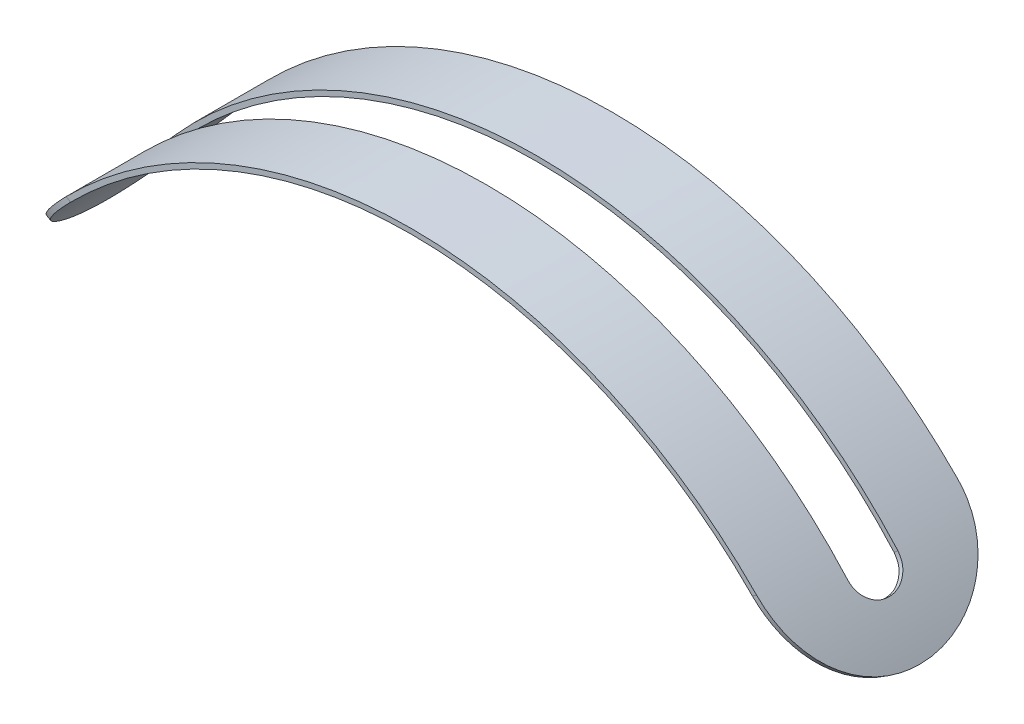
ISO-10303-21;
HEADER;
FILE_DESCRIPTION(('STEP AP214'),'2;1');
FILE_NAME('part.step','',(''),(''),'','','');
FILE_SCHEMA(('AUTOMOTIVE_DESIGN { 1 0 10303 214 1 1 1 1 }'));
ENDSEC;
DATA;
#1=APPLICATION_CONTEXT('core data for automotive mechanical design processes');
#2=APPLICATION_PROTOCOL_DEFINITION('international standard','automotive_design',2000,#1);
#3=PRODUCT_CONTEXT('',#1,'mechanical');
#4=PRODUCT('Part','Part','',(#3));
#5=PRODUCT_RELATED_PRODUCT_CATEGORY('part','',(#4));
#6=PRODUCT_DEFINITION_FORMATION('','',#4);
#7=PRODUCT_DEFINITION_CONTEXT('part definition',#1,'design');
#8=PRODUCT_DEFINITION('design','',#6,#7);
#9=PRODUCT_DEFINITION_SHAPE('','',#8);
#10=(LENGTH_UNIT() NAMED_UNIT(*) SI_UNIT(.MILLI.,.METRE.));
#11=(NAMED_UNIT(*) PLANE_ANGLE_UNIT() SI_UNIT($,.RADIAN.));
#12=(NAMED_UNIT(*) SI_UNIT($,.STERADIAN.) SOLID_ANGLE_UNIT());
#13=UNCERTAINTY_MEASURE_WITH_UNIT(LENGTH_MEASURE(1.E-05),#10,'distance_accuracy_value','');
#14=(GEOMETRIC_REPRESENTATION_CONTEXT(3) GLOBAL_UNCERTAINTY_ASSIGNED_CONTEXT((#13)) GLOBAL_UNIT_ASSIGNED_CONTEXT((#10,
#11,#12)) REPRESENTATION_CONTEXT('',''));
#15=CARTESIAN_POINT('',(0.,0.,0.));
#16=DIRECTION('',(0.,0.,1.));
#17=DIRECTION('',(1.,0.,0.));
#18=AXIS2_PLACEMENT_3D('',#15,#16,#17);
#19=CARTESIAN_POINT('',(-71.7289347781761,64.0250541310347,-5.));
#20=CARTESIAN_POINT('',(-72.1944703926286,63.5035024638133,-4.99374508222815));
#21=CARTESIAN_POINT('',(-72.6182688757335,63.0173282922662,-4.86781746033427));
#22=CARTESIAN_POINT('',(-73.1949357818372,62.3444966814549,-4.49941681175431));
#23=CARTESIAN_POINT('',(-73.3773139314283,62.1296179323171,-4.34669840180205));
#24=CARTESIAN_POINT('',(-73.6365127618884,61.8217568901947,-4.07274349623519));
#25=CARTESIAN_POINT('',(-73.7205172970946,61.7215456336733,-3.97394564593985));
#26=CARTESIAN_POINT('',(-73.8837983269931,61.5259962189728,-3.76139084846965));
#27=CARTESIAN_POINT('',(-73.9626287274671,61.4311965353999,-3.64833680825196));
#28=CARTESIAN_POINT('',(-74.3495696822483,60.9641252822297,-3.03863979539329));
#29=CARTESIAN_POINT('',(-74.5790608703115,60.6817118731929,-2.50091193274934));
#30=CARTESIAN_POINT('',(-74.8079792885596,60.3989121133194,-1.61936476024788));
#31=CARTESIAN_POINT('',(-74.865033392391,60.3280870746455,-1.31302313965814));
#32=CARTESIAN_POINT('',(-74.9410389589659,60.2336450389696,-0.675354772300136));
#33=CARTESIAN_POINT('',(-74.9599905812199,60.2100278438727,-0.344986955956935));
#34=CARTESIAN_POINT('',(-74.9598921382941,60.2101504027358,0.689347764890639));
#35=CARTESIAN_POINT('',(-74.8841084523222,60.3048650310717,1.32792881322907));
#36=CARTESIAN_POINT('',(-74.6552497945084,60.5875896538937,2.2093372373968));
#37=CARTESIAN_POINT('',(-74.5597329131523,60.7052463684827,2.49039618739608));
#38=CARTESIAN_POINT('',(-74.387113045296,60.9164454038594,2.89286882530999));
#39=CARTESIAN_POINT('',(-74.3246802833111,60.99262900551,3.02384040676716));
#40=CARTESIAN_POINT('',(-74.2236113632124,61.1155133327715,3.21551883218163));
#41=CARTESIAN_POINT('',(-74.188684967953,61.1579094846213,3.27861514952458));
#42=CARTESIAN_POINT('',(-74.134429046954,61.2236463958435,3.37206488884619));
#43=CARTESIAN_POINT('',(-74.1160326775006,61.245915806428,3.40301567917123));
#44=CARTESIAN_POINT('',(-74.0786158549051,61.2911671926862,3.46451901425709));
#45=CARTESIAN_POINT('',(-74.059311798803,61.3144915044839,3.49551681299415));
#46=CARTESIAN_POINT('',(-73.8878626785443,61.5214471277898,3.76469032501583));
#47=CARTESIAN_POINT('',(-73.7247057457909,61.7170038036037,3.97562197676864));
#48=CARTESIAN_POINT('',(-73.4634080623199,62.0273617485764,4.24951891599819));
#49=CARTESIAN_POINT('',(-73.3735479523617,62.1336510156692,4.33373447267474));
#50=CARTESIAN_POINT('',(-73.2345588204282,62.2972885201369,4.44943267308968));
#51=CARTESIAN_POINT('',(-73.1875292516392,62.3525349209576,4.48622788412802));
#52=CARTESIAN_POINT('',(-73.1159276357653,62.4364486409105,4.53876441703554));
#53=CARTESIAN_POINT('',(-73.0918842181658,62.46459389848,4.55583388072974));
#54=CARTESIAN_POINT('',(-73.055553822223,62.5070719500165,4.58077400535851));
#55=CARTESIAN_POINT('',(-73.0433994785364,62.5212746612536,4.58897670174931));
#56=CARTESIAN_POINT('',(-73.0251015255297,62.5426436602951,4.60111472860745));
#57=CARTESIAN_POINT('',(-73.0189911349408,62.5497774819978,4.60513306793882));
#58=CARTESIAN_POINT('',(-73.0098089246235,62.5604944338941,4.61111907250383));
#59=CARTESIAN_POINT('',(-73.0067454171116,62.564069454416,4.61310748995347));
#60=CARTESIAN_POINT('',(-73.0021459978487,62.5694360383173,4.61607974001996));
#61=CARTESIAN_POINT('',(-73.0006121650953,62.5712255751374,4.6170687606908));
#62=CARTESIAN_POINT('',(-72.9975431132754,62.5748059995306,4.61904334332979));
#63=CARTESIAN_POINT('',(-72.9955900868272,62.5770842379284,4.62029653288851));
#64=CARTESIAN_POINT('',(-72.7082371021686,62.9122667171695,4.80436122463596));
#65=CARTESIAN_POINT('',(-72.2893950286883,63.3971559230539,4.93068925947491));
#66=CARTESIAN_POINT('',(-71.7289347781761,64.0250541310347,5.));
#67=CARTESIAN_POINT('',(-70.9829008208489,63.3591462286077,-5.));
#68=CARTESIAN_POINT('',(-71.4435945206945,62.8430190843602,-4.99374508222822));
#69=CARTESIAN_POINT('',(-71.8629851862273,62.3619014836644,-4.86781746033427));
#70=CARTESIAN_POINT('',(-72.433654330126,61.6960678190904,-4.49941681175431));
#71=CARTESIAN_POINT('',(-72.6141356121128,61.4834239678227,-4.34669840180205));
#72=CARTESIAN_POINT('',(-72.8706385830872,61.1787649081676,-4.07274349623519));
#73=CARTESIAN_POINT('',(-72.9537694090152,61.0795959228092,-3.97394564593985));
#74=CARTESIAN_POINT('',(-73.1153521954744,60.8860803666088,-3.76139084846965));
#75=CARTESIAN_POINT('',(-73.1933627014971,60.7922666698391,-3.64833680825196));
#76=CARTESIAN_POINT('',(-73.5762791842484,60.3300533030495,-3.03863979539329));
#77=CARTESIAN_POINT('',(-73.8033834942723,60.0505772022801,-2.50091193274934));
#78=CARTESIAN_POINT('',(-74.0299209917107,59.7707187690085,-1.61936476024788));
#79=CARTESIAN_POINT('',(-74.0863816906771,59.7006303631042,-1.31302313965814));
#80=CARTESIAN_POINT('',(-74.1615967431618,59.6071705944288,-0.675354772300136));
#81=CARTESIAN_POINT('',(-74.1803512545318,59.5837990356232,-0.344986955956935));
#82=CARTESIAN_POINT('',(-74.1802538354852,59.5839203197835,0.689347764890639));
#83=CARTESIAN_POINT('',(-74.105258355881,59.6776498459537,1.32792881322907));
#84=CARTESIAN_POINT('',(-73.8787799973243,59.9574339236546,2.2093372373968));
#85=CARTESIAN_POINT('',(-73.7842565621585,60.0738669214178,2.49039618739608));
#86=CARTESIAN_POINT('',(-73.6134320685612,60.2828693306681,2.89286882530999));
#87=CARTESIAN_POINT('',(-73.5516486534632,60.3582605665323,3.02384040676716));
#88=CARTESIAN_POINT('',(-73.4516309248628,60.4798668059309,3.21551883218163));
#89=CARTESIAN_POINT('',(-73.4170677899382,60.5218220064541,3.27861514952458));
#90=CARTESIAN_POINT('',(-73.363376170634,60.5868752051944,3.37206488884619));
#91=CARTESIAN_POINT('',(-73.3451711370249,60.608912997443,3.40301567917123));
#92=CARTESIAN_POINT('',(-73.30814347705,60.6536937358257,3.46451901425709));
#93=CARTESIAN_POINT('',(-73.2890401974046,60.676775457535,3.49551681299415));
#94=CARTESIAN_POINT('',(-73.1193742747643,60.8815785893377,3.76469032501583));
#95=CARTESIAN_POINT('',(-72.9579142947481,61.0751013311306,3.97562197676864));
#96=CARTESIAN_POINT('',(-72.6993343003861,61.3822313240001,4.24951891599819));
#97=CARTESIAN_POINT('',(-72.610408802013,61.4874151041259,4.33373447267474));
#98=CARTESIAN_POINT('',(-72.4728652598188,61.6493506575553,4.44943267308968));
#99=CARTESIAN_POINT('',(-72.4263248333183,61.7040224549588,4.48622788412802));
#100=CARTESIAN_POINT('',(-72.355467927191,61.7870634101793,4.53876441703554));
#101=CARTESIAN_POINT('',(-72.331674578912,61.8149159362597,4.55583388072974));
#102=CARTESIAN_POINT('',(-72.2957220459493,61.8569521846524,4.58077400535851));
#103=CARTESIAN_POINT('',(-72.2836941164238,61.8710071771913,4.58897670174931));
#104=CARTESIAN_POINT('',(-72.2655864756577,61.8921539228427,4.60111472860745));
#105=CARTESIAN_POINT('',(-72.2595396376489,61.8992135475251,4.60513306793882));
#106=CARTESIAN_POINT('',(-72.2504529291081,61.9098190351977,4.61111907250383));
#107=CARTESIAN_POINT('',(-72.2474212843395,61.9133568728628,4.61310748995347));
#108=CARTESIAN_POINT('',(-72.2428697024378,61.9186676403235,4.61607974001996));
#109=CARTESIAN_POINT('',(-72.2413518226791,61.9204385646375,4.6170687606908));
#110=CARTESIAN_POINT('',(-72.2383146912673,61.9239817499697,4.61904334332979));
#111=CARTESIAN_POINT('',(-72.2363819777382,61.9262362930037,4.62029653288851));
#112=CARTESIAN_POINT('',(-71.9520176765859,62.2579326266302,4.80436122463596));
#113=CARTESIAN_POINT('',(-71.5375318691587,62.7377786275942,4.9306892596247));
#114=CARTESIAN_POINT('',(-70.9829008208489,63.3591462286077,5.));
#115=B_SPLINE_SURFACE_WITH_KNOTS('',1,3,((#19,#20,#21,#22,#23,#24,#25,#26,#27,#28,#29,#30,#31,
#32,#33,#34,#35,#36,#37,#38,#39,#40,#41,#42,#43,#44,#45,#46,#47,#48,#49,#50,#51,#52,#53,#54,#55,
#56,#57,#58,#59,#60,#61,#62,#63,#64,#65,#66),(#67,#68,#69,#70,#71,#72,#73,#74,#75,#76,#77,#78,
#79,#80,#81,#82,#83,#84,#85,#86,#87,#88,#89,#90,#91,#92,#93,#94,#95,#96,#97,#98,#99,#100,#101,
#102,#103,#104,#105,#106,#107,#108,#109,#110,#111,#112,#113,#114)),.UNSPECIFIED.,.F.,.F.,.F.,(2,
2),(4,2,2,2,2,2,2,2,2,2,2,2,2,2,2,2,2,2,2,2,2,2,2,4),(0.,1.),(0.,0.125,0.1875,0.21875,0.25,
0.375,0.4375,0.5,0.625,0.6875,0.71875,0.734375,0.7421875,0.75,0.8125,0.84375,0.859375,0.8671875,
0.87109375,0.873046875,0.8740234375,0.87451171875,0.875,1.),.UNSPECIFIED.);
#116=CARTESIAN_POINT('',(-70.9829008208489,63.3591462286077,-5.));
#117=CARTESIAN_POINT('',(-71.7289347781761,64.0250541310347,-5.));
#118=B_SPLINE_CURVE_WITH_KNOTS('',1,(#116,#117),.UNSPECIFIED.,.F.,.F.,(2,2),(0.,1.),.UNSPECIFIED.);
#119=CARTESIAN_POINT('',(-71.7289347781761,64.0250541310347,-5.));
#120=VERTEX_POINT('',#119);
#121=CARTESIAN_POINT('',(-70.9829008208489,63.3591462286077,-5.));
#122=VERTEX_POINT('',#121);
#123=EDGE_CURVE('E139',#120,#122,#118,.F.);
#124=CARTESIAN_POINT('',(-71.7289347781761,64.0250541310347,-5.));
#125=CARTESIAN_POINT('',(-72.1944703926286,63.5035024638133,-4.99374508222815));
#126=CARTESIAN_POINT('',(-72.6182688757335,63.0173282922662,-4.86781746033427));
#127=CARTESIAN_POINT('',(-73.1949357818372,62.3444966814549,-4.49941681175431));
#128=CARTESIAN_POINT('',(-73.3773139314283,62.1296179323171,-4.34669840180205));
#129=CARTESIAN_POINT('',(-73.6365127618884,61.8217568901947,-4.07274349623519));
#130=CARTESIAN_POINT('',(-73.7205172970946,61.7215456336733,-3.97394564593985));
#131=CARTESIAN_POINT('',(-73.8837983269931,61.5259962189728,-3.76139084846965));
#132=CARTESIAN_POINT('',(-73.9626287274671,61.4311965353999,-3.64833680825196));
#133=CARTESIAN_POINT('',(-74.3495696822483,60.9641252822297,-3.03863979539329));
#134=CARTESIAN_POINT('',(-74.5790608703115,60.6817118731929,-2.50091193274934));
#135=CARTESIAN_POINT('',(-74.8079792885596,60.3989121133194,-1.61936476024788));
#136=CARTESIAN_POINT('',(-74.865033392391,60.3280870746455,-1.31302313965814));
#137=CARTESIAN_POINT('',(-74.9410389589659,60.2336450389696,-0.675354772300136));
#138=CARTESIAN_POINT('',(-74.9599905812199,60.2100278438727,-0.344986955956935));
#139=CARTESIAN_POINT('',(-74.9598921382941,60.2101504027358,0.689347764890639));
#140=CARTESIAN_POINT('',(-74.8841084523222,60.3048650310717,1.32792881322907));
#141=CARTESIAN_POINT('',(-74.6552497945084,60.5875896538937,2.2093372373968));
#142=CARTESIAN_POINT('',(-74.5597329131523,60.7052463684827,2.49039618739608));
#143=CARTESIAN_POINT('',(-74.387113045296,60.9164454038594,2.89286882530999));
#144=CARTESIAN_POINT('',(-74.3246802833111,60.99262900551,3.02384040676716));
#145=CARTESIAN_POINT('',(-74.2236113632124,61.1155133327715,3.21551883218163));
#146=CARTESIAN_POINT('',(-74.188684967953,61.1579094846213,3.27861514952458));
#147=CARTESIAN_POINT('',(-74.134429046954,61.2236463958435,3.37206488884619));
#148=CARTESIAN_POINT('',(-74.1160326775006,61.245915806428,3.40301567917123));
#149=CARTESIAN_POINT('',(-74.0786158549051,61.2911671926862,3.46451901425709));
#150=CARTESIAN_POINT('',(-74.059311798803,61.3144915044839,3.49551681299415));
#151=CARTESIAN_POINT('',(-73.8878626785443,61.5214471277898,3.76469032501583));
#152=CARTESIAN_POINT('',(-73.7247057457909,61.7170038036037,3.97562197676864));
#153=CARTESIAN_POINT('',(-73.4634080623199,62.0273617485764,4.24951891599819));
#154=CARTESIAN_POINT('',(-73.3735479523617,62.1336510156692,4.33373447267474));
#155=CARTESIAN_POINT('',(-73.2345588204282,62.2972885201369,4.44943267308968));
#156=CARTESIAN_POINT('',(-73.1875292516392,62.3525349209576,4.48622788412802));
#157=CARTESIAN_POINT('',(-73.1159276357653,62.4364486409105,4.53876441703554));
#158=CARTESIAN_POINT('',(-73.0918842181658,62.46459389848,4.55583388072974));
#159=CARTESIAN_POINT('',(-73.055553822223,62.5070719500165,4.58077400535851));
#160=CARTESIAN_POINT('',(-73.0433994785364,62.5212746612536,4.58897670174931));
#161=CARTESIAN_POINT('',(-73.0251015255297,62.5426436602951,4.60111472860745));
#162=CARTESIAN_POINT('',(-73.0189911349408,62.5497774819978,4.60513306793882));
#163=CARTESIAN_POINT('',(-73.0098089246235,62.5604944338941,4.61111907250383));
#164=CARTESIAN_POINT('',(-73.0067454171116,62.564069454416,4.61310748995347));
#165=CARTESIAN_POINT('',(-73.0021459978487,62.5694360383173,4.61607974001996));
#166=CARTESIAN_POINT('',(-73.0006121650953,62.5712255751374,4.6170687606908));
#167=CARTESIAN_POINT('',(-72.9975431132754,62.5748059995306,4.61904334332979));
#168=CARTESIAN_POINT('',(-72.9955900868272,62.5770842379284,4.62029653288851));
#169=CARTESIAN_POINT('',(-72.7082371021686,62.9122667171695,4.80436122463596));
#170=CARTESIAN_POINT('',(-72.2893950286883,63.3971559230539,4.93068925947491));
#171=CARTESIAN_POINT('',(-71.7289347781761,64.0250541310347,5.));
#172=B_SPLINE_CURVE_WITH_KNOTS('',3,(#124,#125,#126,#127,#128,#129,#130,#131,#132,#133,#134,
#135,#136,#137,#138,#139,#140,#141,#142,#143,#144,#145,#146,#147,#148,#149,#150,#151,#152,#153,
#154,#155,#156,#157,#158,#159,#160,#161,#162,#163,#164,#165,#166,#167,#168,#169,#170,#171),
.UNSPECIFIED.,.F.,.F.,(4,2,2,2,2,2,2,2,2,2,2,2,2,2,2,2,2,2,2,2,2,2,2,4),(0.,0.125,0.1875,
0.21875,0.25,0.375,0.4375,0.5,0.625,0.6875,0.71875,0.734375,0.7421875,0.75,0.8125,0.84375,
0.859375,0.8671875,0.87109375,0.873046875,0.8740234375,0.87451171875,0.875,1.),.UNSPECIFIED.);
#173=CARTESIAN_POINT('',(-71.7289347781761,64.0250541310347,5.));
#174=VERTEX_POINT('',#173);
#175=EDGE_CURVE('E393',#120,#174,#172,.T.);
#176=CARTESIAN_POINT('',(-71.7289347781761,64.0250541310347,5.));
#177=CARTESIAN_POINT('',(-70.9829008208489,63.3591462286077,5.));
#178=B_SPLINE_CURVE_WITH_KNOTS('',1,(#176,#177),.UNSPECIFIED.,.F.,.F.,(2,2),(0.,1.),.UNSPECIFIED.);
#179=CARTESIAN_POINT('',(-70.9829008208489,63.3591462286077,5.));
#180=VERTEX_POINT('',#179);
#181=EDGE_CURVE('E152',#174,#180,#178,.T.);
#182=CARTESIAN_POINT('',(-70.9829008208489,63.3591462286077,5.));
#183=CARTESIAN_POINT('',(-71.5375318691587,62.7377786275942,4.9306892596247));
#184=CARTESIAN_POINT('',(-71.9520176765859,62.2579326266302,4.80436122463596));
#185=CARTESIAN_POINT('',(-72.2363819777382,61.9262362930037,4.62029653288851));
#186=CARTESIAN_POINT('',(-72.2383146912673,61.9239817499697,4.61904334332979));
#187=CARTESIAN_POINT('',(-72.2413518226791,61.9204385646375,4.6170687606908));
#188=CARTESIAN_POINT('',(-72.2428697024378,61.9186676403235,4.61607974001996));
#189=CARTESIAN_POINT('',(-72.2474212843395,61.9133568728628,4.61310748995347));
#190=CARTESIAN_POINT('',(-72.2504529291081,61.9098190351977,4.61111907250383));
#191=CARTESIAN_POINT('',(-72.2595396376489,61.8992135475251,4.60513306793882));
#192=CARTESIAN_POINT('',(-72.2655864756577,61.8921539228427,4.60111472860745));
#193=CARTESIAN_POINT('',(-72.2836941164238,61.8710071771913,4.58897670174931));
#194=CARTESIAN_POINT('',(-72.2957220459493,61.8569521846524,4.58077400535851));
#195=CARTESIAN_POINT('',(-72.331674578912,61.8149159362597,4.55583388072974));
#196=CARTESIAN_POINT('',(-72.355467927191,61.7870634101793,4.53876441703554));
#197=CARTESIAN_POINT('',(-72.4263248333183,61.7040224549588,4.48622788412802));
#198=CARTESIAN_POINT('',(-72.4728652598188,61.6493506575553,4.44943267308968));
#199=CARTESIAN_POINT('',(-72.610408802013,61.4874151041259,4.33373447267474));
#200=CARTESIAN_POINT('',(-72.6993343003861,61.3822313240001,4.24951891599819));
#201=CARTESIAN_POINT('',(-72.9579142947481,61.0751013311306,3.97562197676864));
#202=CARTESIAN_POINT('',(-73.1193742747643,60.8815785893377,3.76469032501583));
#203=CARTESIAN_POINT('',(-73.2890401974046,60.676775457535,3.49551681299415));
#204=CARTESIAN_POINT('',(-73.30814347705,60.6536937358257,3.46451901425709));
#205=CARTESIAN_POINT('',(-73.3451711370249,60.608912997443,3.40301567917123));
#206=CARTESIAN_POINT('',(-73.363376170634,60.5868752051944,3.37206488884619));
#207=CARTESIAN_POINT('',(-73.4170677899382,60.5218220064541,3.27861514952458));
#208=CARTESIAN_POINT('',(-73.4516309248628,60.4798668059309,3.21551883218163));
#209=CARTESIAN_POINT('',(-73.5516486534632,60.3582605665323,3.02384040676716));
#210=CARTESIAN_POINT('',(-73.6134320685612,60.2828693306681,2.89286882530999));
#211=CARTESIAN_POINT('',(-73.7842565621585,60.0738669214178,2.49039618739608));
#212=CARTESIAN_POINT('',(-73.8787799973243,59.9574339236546,2.2093372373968));
#213=CARTESIAN_POINT('',(-74.105258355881,59.6776498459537,1.32792881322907));
#214=CARTESIAN_POINT('',(-74.1802538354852,59.5839203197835,0.689347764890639));
#215=CARTESIAN_POINT('',(-74.1803512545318,59.5837990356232,-0.344986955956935));
#216=CARTESIAN_POINT('',(-74.1615967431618,59.6071705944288,-0.675354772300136));
#217=CARTESIAN_POINT('',(-74.0863816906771,59.7006303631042,-1.31302313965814));
#218=CARTESIAN_POINT('',(-74.0299209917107,59.7707187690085,-1.61936476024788));
#219=CARTESIAN_POINT('',(-73.8033834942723,60.0505772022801,-2.50091193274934));
#220=CARTESIAN_POINT('',(-73.5762791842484,60.3300533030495,-3.03863979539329));
#221=CARTESIAN_POINT('',(-73.1933627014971,60.7922666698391,-3.64833680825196));
#222=CARTESIAN_POINT('',(-73.1153521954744,60.8860803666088,-3.76139084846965));
#223=CARTESIAN_POINT('',(-72.9537694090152,61.0795959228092,-3.97394564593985));
#224=CARTESIAN_POINT('',(-72.8706385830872,61.1787649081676,-4.07274349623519));
#225=CARTESIAN_POINT('',(-72.6141356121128,61.4834239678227,-4.34669840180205));
#226=CARTESIAN_POINT('',(-72.433654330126,61.6960678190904,-4.49941681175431));
#227=CARTESIAN_POINT('',(-71.8629851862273,62.3619014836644,-4.86781746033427));
#228=CARTESIAN_POINT('',(-71.4435945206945,62.8430190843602,-4.99374508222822));
#229=CARTESIAN_POINT('',(-70.9829008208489,63.3591462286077,-5.));
#230=B_SPLINE_CURVE_WITH_KNOTS('',3,(#182,#183,#184,#185,#186,#187,#188,#189,#190,#191,#192,
#193,#194,#195,#196,#197,#198,#199,#200,#201,#202,#203,#204,#205,#206,#207,#208,#209,#210,#211,
#212,#213,#214,#215,#216,#217,#218,#219,#220,#221,#222,#223,#224,#225,#226,#227,#228,#229),
.UNSPECIFIED.,.F.,.F.,(4,2,2,2,2,2,2,2,2,2,2,2,2,2,2,2,2,2,2,2,2,2,2,4),(0.,0.125,0.12548828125,
0.1259765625,0.126953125,0.12890625,0.1328125,0.140625,0.15625,0.1875,0.25,0.2578125,0.265625,
0.28125,0.3125,0.375,0.5,0.5625,0.625,0.75,0.78125,0.8125,0.875,1.),.UNSPECIFIED.);
#231=EDGE_CURVE('E156',#122,#180,#230,.F.);
#232=ORIENTED_EDGE('',*,*,#123,.F.);
#233=ORIENTED_EDGE('',*,*,#175,.T.);
#234=ORIENTED_EDGE('',*,*,#181,.T.);
#235=ORIENTED_EDGE('',*,*,#231,.F.);
#236=EDGE_LOOP('',(#232,#233,#234,#235));
#237=FACE_BOUND('',#236,.T.);
#238=ADVANCED_FACE('F49',(#237),#115,.F.);
#239=CARTESIAN_POINT('',(0.,0.,5.00000000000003));
#240=DIRECTION('',(0.,0.,1.));
#241=DIRECTION('',(0.,-1.,0.));
#242=AXIS2_PLACEMENT_3D('',#239,#240,#241);
#243=PLANE('',#242);
#244=ORIENTED_EDGE('',*,*,#181,.F.);
#245=CARTESIAN_POINT('',(0.,0.,5.));
#246=DIRECTION('',(0.,0.,1.));
#247=DIRECTION('',(1.,0.,0.));
#248=AXIS2_PLACEMENT_3D('',#245,#246,#247);
#249=CIRCLE('',#248,96.1470105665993);
#250=CARTESIAN_POINT('',(71.7289347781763,64.0250541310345,5.));
#251=VERTEX_POINT('',#250);
#252=EDGE_CURVE('E194',#174,#251,#249,.F.);
#253=ORIENTED_EDGE('',*,*,#252,.T.);
#254=CARTESIAN_POINT('',(70.9829008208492,63.3591462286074,5.00000000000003));
#255=CARTESIAN_POINT('',(71.7289347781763,64.0250541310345,5.00000000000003));
#256=B_SPLINE_CURVE_WITH_KNOTS('',1,(#254,#255),.UNSPECIFIED.,.F.,.F.,(2,2),(0.,1.),.UNSPECIFIED.);
#257=CARTESIAN_POINT('',(70.9829008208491,63.3591462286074,5.00000000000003));
#258=VERTEX_POINT('',#257);
#259=EDGE_CURVE('E175',#251,#258,#256,.F.);
#260=ORIENTED_EDGE('',*,*,#259,.T.);
#261=CARTESIAN_POINT('',(0.,0.,5.00000000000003));
#262=DIRECTION('',(0.,0.,-1.));
#263=DIRECTION('',(0.,-1.,0.));
#264=AXIS2_PLACEMENT_3D('',#261,#262,#263);
#265=CIRCLE('',#264,95.1470105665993);
#266=EDGE_CURVE('E164',#180,#258,#265,.T.);
#267=ORIENTED_EDGE('',*,*,#266,.F.);
#268=EDGE_LOOP('',(#244,#253,#260,#267));
#269=FACE_BOUND('',#268,.T.);
#270=ADVANCED_FACE('F346',(#269),#243,.F.);
#271=CARTESIAN_POINT('',(71.7289347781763,64.0250541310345,5.00000000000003));
#272=CARTESIAN_POINT('',(72.1944703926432,63.5035024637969,4.99374508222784));
#273=CARTESIAN_POINT('',(72.6182688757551,63.0173282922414,4.86781746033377));
#274=CARTESIAN_POINT('',(73.1949357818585,62.3444966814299,4.49941681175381));
#275=CARTESIAN_POINT('',(73.3773139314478,62.1296179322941,4.34669840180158));
#276=CARTESIAN_POINT('',(73.6365127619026,61.8217568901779,4.07274349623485));
#277=CARTESIAN_POINT('',(73.7205172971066,61.721545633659,3.97394564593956));
#278=CARTESIAN_POINT('',(73.8837983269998,61.5259962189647,3.76139084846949));
#279=CARTESIAN_POINT('',(73.9626287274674,61.4311965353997,3.64833680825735));
#280=CARTESIAN_POINT('',(74.3495696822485,60.9641252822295,3.03863979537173));
#281=CARTESIAN_POINT('',(74.5790608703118,60.6817118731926,2.50091193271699));
#282=CARTESIAN_POINT('',(74.8079792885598,60.3989121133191,1.61936476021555));
#283=CARTESIAN_POINT('',(74.8650333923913,60.3280870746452,1.31302313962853));
#284=CARTESIAN_POINT('',(74.9410389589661,60.2336450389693,0.675354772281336));
#285=CARTESIAN_POINT('',(74.9599905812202,60.2100278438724,0.34498695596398));
#286=CARTESIAN_POINT('',(74.9598921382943,60.2101504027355,-0.689347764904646));
#287=CARTESIAN_POINT('',(74.8841084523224,60.3048650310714,-1.32792881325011));
#288=CARTESIAN_POINT('',(74.6552497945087,60.5875896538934,-2.20933723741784));
#289=CARTESIAN_POINT('',(74.5597329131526,60.7052463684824,-2.49039618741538));
#290=CARTESIAN_POINT('',(74.3871130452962,60.916445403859,-2.89286882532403));
#291=CARTESIAN_POINT('',(74.3246802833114,60.9926290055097,-3.02384040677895));
#292=CARTESIAN_POINT('',(74.2236113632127,61.1155133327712,-3.21551883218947));
#293=CARTESIAN_POINT('',(74.1886849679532,61.157909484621,-3.27861514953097));
#294=CARTESIAN_POINT('',(74.1344290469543,61.2236463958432,-3.37206488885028));
#295=CARTESIAN_POINT('',(74.1160326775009,61.2459158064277,-3.40301567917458));
#296=CARTESIAN_POINT('',(74.0786158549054,61.2911671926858,-3.4645190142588));
#297=CARTESIAN_POINT('',(74.0593117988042,61.3144915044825,-3.49551681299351));
#298=CARTESIAN_POINT('',(73.887862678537,61.5214471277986,-3.76469032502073));
#299=CARTESIAN_POINT('',(73.7247057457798,61.717003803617,-3.97562197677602));
#300=CARTESIAN_POINT('',(73.4634080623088,62.0273617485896,-4.24951891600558));
#301=CARTESIAN_POINT('',(73.3735479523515,62.1336510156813,-4.33373447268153));
#302=CARTESIAN_POINT('',(73.2345588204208,62.2972885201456,-4.44943267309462));
#303=CARTESIAN_POINT('',(73.187529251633,62.3525349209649,-4.48622788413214));
#304=CARTESIAN_POINT('',(73.1159276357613,62.4364486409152,-4.53876441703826));
#305=CARTESIAN_POINT('',(73.0918842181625,62.4645938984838,-4.55583388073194));
#306=CARTESIAN_POINT('',(73.055553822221,62.5070719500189,-4.5807740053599));
#307=CARTESIAN_POINT('',(73.0433994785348,62.5212746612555,-4.58897670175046));
#308=CARTESIAN_POINT('',(73.0251015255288,62.5426436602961,-4.60111472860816));
#309=CARTESIAN_POINT('',(73.0189911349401,62.5497774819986,-4.60513306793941));
#310=CARTESIAN_POINT('',(73.0098089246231,62.5604944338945,-4.6111190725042));
#311=CARTESIAN_POINT('',(73.0067454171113,62.5640694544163,-4.61310748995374));
#312=CARTESIAN_POINT('',(73.0021459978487,62.5694360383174,-4.61607974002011));
#313=CARTESIAN_POINT('',(73.0006121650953,62.5712255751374,-4.61706876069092));
#314=CARTESIAN_POINT('',(72.9975431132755,62.5748059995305,-4.61904334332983));
#315=CARTESIAN_POINT('',(72.9955900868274,62.5770842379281,-4.62029653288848));
#316=CARTESIAN_POINT('',(72.7082371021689,62.9122667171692,-4.80436122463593));
#317=CARTESIAN_POINT('',(72.2893950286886,63.3971559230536,-4.93068925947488));
#318=CARTESIAN_POINT('',(71.7289347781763,64.0250541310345,-4.99999999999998));
#319=CARTESIAN_POINT('',(70.9829008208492,63.3591462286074,5.00000000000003));
#320=CARTESIAN_POINT('',(71.443594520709,62.843019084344,4.9937450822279));
#321=CARTESIAN_POINT('',(71.8629851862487,62.3619014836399,4.86781746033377));
#322=CARTESIAN_POINT('',(72.433654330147,61.6960678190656,4.49941681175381));
#323=CARTESIAN_POINT('',(72.6141356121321,61.4834239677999,4.34669840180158));
#324=CARTESIAN_POINT('',(72.8706385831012,61.178764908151,4.07274349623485));
#325=CARTESIAN_POINT('',(72.953769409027,61.0795959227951,3.97394564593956));
#326=CARTESIAN_POINT('',(73.115352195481,60.8860803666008,3.76139084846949));
#327=CARTESIAN_POINT('',(73.1933627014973,60.7922666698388,3.64833680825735));
#328=CARTESIAN_POINT('',(73.5762791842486,60.3300533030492,3.03863979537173));
#329=CARTESIAN_POINT('',(73.8033834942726,60.0505772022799,2.50091193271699));
#330=CARTESIAN_POINT('',(74.0299209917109,59.7707187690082,1.61936476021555));
#331=CARTESIAN_POINT('',(74.0863816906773,59.7006303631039,1.31302313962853));
#332=CARTESIAN_POINT('',(74.1615967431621,59.6071705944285,0.675354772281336));
#333=CARTESIAN_POINT('',(74.1803512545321,59.5837990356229,0.34498695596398));
#334=CARTESIAN_POINT('',(74.1802538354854,59.5839203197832,-0.689347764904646));
#335=CARTESIAN_POINT('',(74.1052583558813,59.6776498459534,-1.32792881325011));
#336=CARTESIAN_POINT('',(73.8787799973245,59.9574339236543,-2.20933723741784));
#337=CARTESIAN_POINT('',(73.7842565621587,60.0738669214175,-2.49039618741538));
#338=CARTESIAN_POINT('',(73.6134320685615,60.2828693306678,-2.89286882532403));
#339=CARTESIAN_POINT('',(73.5516486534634,60.358260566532,-3.02384040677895));
#340=CARTESIAN_POINT('',(73.4516309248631,60.4798668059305,-3.21551883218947));
#341=CARTESIAN_POINT('',(73.4170677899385,60.5218220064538,-3.27861514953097));
#342=CARTESIAN_POINT('',(73.3633761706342,60.5868752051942,-3.37206488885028));
#343=CARTESIAN_POINT('',(73.3451711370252,60.6089129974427,-3.40301567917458));
#344=CARTESIAN_POINT('',(73.3081434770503,60.6536937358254,-3.4645190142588));
#345=CARTESIAN_POINT('',(73.2890401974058,60.6767754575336,-3.49551681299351));
#346=CARTESIAN_POINT('',(73.1193742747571,60.8815785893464,-3.76469032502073));
#347=CARTESIAN_POINT('',(72.9579142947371,61.0751013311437,-3.97562197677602));
#348=CARTESIAN_POINT('',(72.699334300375,61.3822313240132,-4.24951891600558));
#349=CARTESIAN_POINT('',(72.6104088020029,61.4874151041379,-4.33373447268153));
#350=CARTESIAN_POINT('',(72.4728652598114,61.6493506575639,-4.44943267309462));
#351=CARTESIAN_POINT('',(72.4263248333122,61.704022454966,-4.48622788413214));
#352=CARTESIAN_POINT('',(72.355467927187,61.7870634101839,-4.53876441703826));
#353=CARTESIAN_POINT('',(72.3316745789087,61.8149159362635,-4.55583388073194));
#354=CARTESIAN_POINT('',(72.2957220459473,61.8569521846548,-4.5807740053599));
#355=CARTESIAN_POINT('',(72.2836941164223,61.8710071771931,-4.58897670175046));
#356=CARTESIAN_POINT('',(72.2655864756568,61.8921539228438,-4.60111472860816));
#357=CARTESIAN_POINT('',(72.2595396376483,61.8992135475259,-4.60513306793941));
#358=CARTESIAN_POINT('',(72.2504529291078,61.909819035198,-4.6111190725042));
#359=CARTESIAN_POINT('',(72.2474212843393,61.913356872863,-4.61310748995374));
#360=CARTESIAN_POINT('',(72.2428697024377,61.9186676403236,-4.61607974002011));
#361=CARTESIAN_POINT('',(72.2413518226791,61.9204385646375,-4.61706876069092));
#362=CARTESIAN_POINT('',(72.2383146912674,61.9239817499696,-4.61904334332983));
#363=CARTESIAN_POINT('',(72.2363819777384,61.9262362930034,-4.62029653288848));
#364=CARTESIAN_POINT('',(71.9520176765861,62.2579326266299,-4.80436122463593));
#365=CARTESIAN_POINT('',(71.5375318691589,62.7377786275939,-4.93068925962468));
#366=CARTESIAN_POINT('',(70.9829008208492,63.3591462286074,-4.99999999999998));
#367=B_SPLINE_SURFACE_WITH_KNOTS('',1,3,((#271,#272,#273,#274,#275,#276,#277,#278,#279,#280,
#281,#282,#283,#284,#285,#286,#287,#288,#289,#290,#291,#292,#293,#294,#295,#296,#297,#298,#299,
#300,#301,#302,#303,#304,#305,#306,#307,#308,#309,#310,#311,#312,#313,#314,#315,#316,#317,#318),
(#319,#320,#321,#322,#323,#324,#325,#326,#327,#328,#329,#330,#331,#332,#333,#334,#335,#336,#337,
#338,#339,#340,#341,#342,#343,#344,#345,#346,#347,#348,#349,#350,#351,#352,#353,#354,#355,#356,
#357,#358,#359,#360,#361,#362,#363,#364,#365,#366)),.UNSPECIFIED.,.F.,.F.,.F.,(2,2),(4,2,2,2,2,
2,2,2,2,2,2,2,2,2,2,2,2,2,2,2,2,2,2,4),(0.,1.),(0.,0.125,0.1875,0.21875,0.25,0.375,0.4375,0.5,
0.625,0.6875,0.71875,0.734375,0.7421875,0.75,0.8125,0.84375,0.859375,0.8671875,0.87109375,
0.873046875,0.8740234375,0.87451171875,0.875,1.),.UNSPECIFIED.);
#368=CARTESIAN_POINT('',(71.7289347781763,64.0250541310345,5.00000000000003));
#369=CARTESIAN_POINT('',(72.1944703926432,63.5035024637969,4.99374508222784));
#370=CARTESIAN_POINT('',(72.6182688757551,63.0173282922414,4.86781746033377));
#371=CARTESIAN_POINT('',(73.1949357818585,62.3444966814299,4.49941681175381));
#372=CARTESIAN_POINT('',(73.3773139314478,62.1296179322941,4.34669840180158));
#373=CARTESIAN_POINT('',(73.6365127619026,61.8217568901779,4.07274349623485));
#374=CARTESIAN_POINT('',(73.7205172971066,61.721545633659,3.97394564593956));
#375=CARTESIAN_POINT('',(73.8837983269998,61.5259962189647,3.76139084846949));
#376=CARTESIAN_POINT('',(73.9626287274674,61.4311965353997,3.64833680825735));
#377=CARTESIAN_POINT('',(74.3495696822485,60.9641252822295,3.03863979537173));
#378=CARTESIAN_POINT('',(74.5790608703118,60.6817118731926,2.50091193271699));
#379=CARTESIAN_POINT('',(74.8079792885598,60.3989121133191,1.61936476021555));
#380=CARTESIAN_POINT('',(74.8650333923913,60.3280870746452,1.31302313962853));
#381=CARTESIAN_POINT('',(74.9410389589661,60.2336450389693,0.675354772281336));
#382=CARTESIAN_POINT('',(74.9599905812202,60.2100278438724,0.34498695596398));
#383=CARTESIAN_POINT('',(74.9598921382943,60.2101504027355,-0.689347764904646));
#384=CARTESIAN_POINT('',(74.8841084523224,60.3048650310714,-1.32792881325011));
#385=CARTESIAN_POINT('',(74.6552497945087,60.5875896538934,-2.20933723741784));
#386=CARTESIAN_POINT('',(74.5597329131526,60.7052463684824,-2.49039618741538));
#387=CARTESIAN_POINT('',(74.3871130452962,60.916445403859,-2.89286882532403));
#388=CARTESIAN_POINT('',(74.3246802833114,60.9926290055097,-3.02384040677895));
#389=CARTESIAN_POINT('',(74.2236113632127,61.1155133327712,-3.21551883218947));
#390=CARTESIAN_POINT('',(74.1886849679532,61.157909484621,-3.27861514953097));
#391=CARTESIAN_POINT('',(74.1344290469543,61.2236463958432,-3.37206488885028));
#392=CARTESIAN_POINT('',(74.1160326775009,61.2459158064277,-3.40301567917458));
#393=CARTESIAN_POINT('',(74.0786158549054,61.2911671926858,-3.4645190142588));
#394=CARTESIAN_POINT('',(74.0593117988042,61.3144915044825,-3.49551681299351));
#395=CARTESIAN_POINT('',(73.887862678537,61.5214471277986,-3.76469032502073));
#396=CARTESIAN_POINT('',(73.7247057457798,61.717003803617,-3.97562197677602));
#397=CARTESIAN_POINT('',(73.4634080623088,62.0273617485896,-4.24951891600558));
#398=CARTESIAN_POINT('',(73.3735479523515,62.1336510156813,-4.33373447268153));
#399=CARTESIAN_POINT('',(73.2345588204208,62.2972885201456,-4.44943267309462));
#400=CARTESIAN_POINT('',(73.187529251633,62.3525349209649,-4.48622788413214));
#401=CARTESIAN_POINT('',(73.1159276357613,62.4364486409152,-4.53876441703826));
#402=CARTESIAN_POINT('',(73.0918842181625,62.4645938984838,-4.55583388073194));
#403=CARTESIAN_POINT('',(73.055553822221,62.5070719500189,-4.5807740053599));
#404=CARTESIAN_POINT('',(73.0433994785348,62.5212746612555,-4.58897670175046));
#405=CARTESIAN_POINT('',(73.0251015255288,62.5426436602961,-4.60111472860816));
#406=CARTESIAN_POINT('',(73.0189911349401,62.5497774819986,-4.60513306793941));
#407=CARTESIAN_POINT('',(73.0098089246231,62.5604944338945,-4.6111190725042));
#408=CARTESIAN_POINT('',(73.0067454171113,62.5640694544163,-4.61310748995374));
#409=CARTESIAN_POINT('',(73.0021459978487,62.5694360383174,-4.61607974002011));
#410=CARTESIAN_POINT('',(73.0006121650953,62.5712255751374,-4.61706876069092));
#411=CARTESIAN_POINT('',(72.9975431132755,62.5748059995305,-4.61904334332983));
#412=CARTESIAN_POINT('',(72.9955900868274,62.5770842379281,-4.62029653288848));
#413=CARTESIAN_POINT('',(72.7082371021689,62.9122667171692,-4.80436122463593));
#414=CARTESIAN_POINT('',(72.2893950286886,63.3971559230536,-4.93068925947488));
#415=CARTESIAN_POINT('',(71.7289347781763,64.0250541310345,-4.99999999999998));
#416=B_SPLINE_CURVE_WITH_KNOTS('',3,(#368,#369,#370,#371,#372,#373,#374,#375,#376,#377,#378,
#379,#380,#381,#382,#383,#384,#385,#386,#387,#388,#389,#390,#391,#392,#393,#394,#395,#396,#397,
#398,#399,#400,#401,#402,#403,#404,#405,#406,#407,#408,#409,#410,#411,#412,#413,#414,#415),
.UNSPECIFIED.,.F.,.F.,(4,2,2,2,2,2,2,2,2,2,2,2,2,2,2,2,2,2,2,2,2,2,2,4),(0.,0.125,0.1875,
0.21875,0.25,0.375,0.4375,0.5,0.625,0.6875,0.71875,0.734375,0.7421875,0.75,0.8125,0.84375,
0.859375,0.8671875,0.87109375,0.873046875,0.8740234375,0.87451171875,0.875,1.),.UNSPECIFIED.);
#417=CARTESIAN_POINT('',(71.7289347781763,64.0250541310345,-4.99999999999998));
#418=VERTEX_POINT('',#417);
#419=EDGE_CURVE('E188',#251,#418,#416,.T.);
#420=CARTESIAN_POINT('',(71.7289347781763,64.0250541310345,-4.99999999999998));
#421=CARTESIAN_POINT('',(70.9829008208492,63.3591462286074,-4.99999999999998));
#422=B_SPLINE_CURVE_WITH_KNOTS('',1,(#420,#421),.UNSPECIFIED.,.F.,.F.,(2,2),(0.,1.),.UNSPECIFIED.);
#423=CARTESIAN_POINT('',(70.9829008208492,63.3591462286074,-4.99999999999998));
#424=VERTEX_POINT('',#423);
#425=EDGE_CURVE('E173',#418,#424,#422,.T.);
#426=CARTESIAN_POINT('',(70.9829008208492,63.3591462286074,-4.99999999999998));
#427=CARTESIAN_POINT('',(71.5375318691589,62.7377786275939,-4.93068925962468));
#428=CARTESIAN_POINT('',(71.9520176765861,62.2579326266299,-4.80436122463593));
#429=CARTESIAN_POINT('',(72.2363819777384,61.9262362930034,-4.62029653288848));
#430=CARTESIAN_POINT('',(72.2383146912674,61.9239817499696,-4.61904334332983));
#431=CARTESIAN_POINT('',(72.2413518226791,61.9204385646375,-4.61706876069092));
#432=CARTESIAN_POINT('',(72.2428697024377,61.9186676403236,-4.61607974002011));
#433=CARTESIAN_POINT('',(72.2474212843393,61.913356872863,-4.61310748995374));
#434=CARTESIAN_POINT('',(72.2504529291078,61.909819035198,-4.6111190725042));
#435=CARTESIAN_POINT('',(72.2595396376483,61.8992135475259,-4.60513306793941));
#436=CARTESIAN_POINT('',(72.2655864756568,61.8921539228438,-4.60111472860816));
#437=CARTESIAN_POINT('',(72.2836941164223,61.8710071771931,-4.58897670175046));
#438=CARTESIAN_POINT('',(72.2957220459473,61.8569521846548,-4.5807740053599));
#439=CARTESIAN_POINT('',(72.3316745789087,61.8149159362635,-4.55583388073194));
#440=CARTESIAN_POINT('',(72.355467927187,61.7870634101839,-4.53876441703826));
#441=CARTESIAN_POINT('',(72.4263248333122,61.704022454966,-4.48622788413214));
#442=CARTESIAN_POINT('',(72.4728652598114,61.6493506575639,-4.44943267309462));
#443=CARTESIAN_POINT('',(72.6104088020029,61.4874151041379,-4.33373447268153));
#444=CARTESIAN_POINT('',(72.699334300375,61.3822313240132,-4.24951891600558));
#445=CARTESIAN_POINT('',(72.9579142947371,61.0751013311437,-3.97562197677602));
#446=CARTESIAN_POINT('',(73.1193742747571,60.8815785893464,-3.76469032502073));
#447=CARTESIAN_POINT('',(73.2890401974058,60.6767754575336,-3.49551681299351));
#448=CARTESIAN_POINT('',(73.3081434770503,60.6536937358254,-3.4645190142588));
#449=CARTESIAN_POINT('',(73.3451711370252,60.6089129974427,-3.40301567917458));
#450=CARTESIAN_POINT('',(73.3633761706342,60.5868752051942,-3.37206488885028));
#451=CARTESIAN_POINT('',(73.4170677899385,60.5218220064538,-3.27861514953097));
#452=CARTESIAN_POINT('',(73.4516309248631,60.4798668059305,-3.21551883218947));
#453=CARTESIAN_POINT('',(73.5516486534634,60.358260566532,-3.02384040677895));
#454=CARTESIAN_POINT('',(73.6134320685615,60.2828693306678,-2.89286882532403));
#455=CARTESIAN_POINT('',(73.7842565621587,60.0738669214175,-2.49039618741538));
#456=CARTESIAN_POINT('',(73.8787799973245,59.9574339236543,-2.20933723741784));
#457=CARTESIAN_POINT('',(74.1052583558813,59.6776498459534,-1.32792881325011));
#458=CARTESIAN_POINT('',(74.1802538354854,59.5839203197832,-0.689347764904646));
#459=CARTESIAN_POINT('',(74.1803512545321,59.5837990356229,0.34498695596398));
#460=CARTESIAN_POINT('',(74.1615967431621,59.6071705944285,0.675354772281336));
#461=CARTESIAN_POINT('',(74.0863816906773,59.7006303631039,1.31302313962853));
#462=CARTESIAN_POINT('',(74.0299209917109,59.7707187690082,1.61936476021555));
#463=CARTESIAN_POINT('',(73.8033834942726,60.0505772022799,2.50091193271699));
#464=CARTESIAN_POINT('',(73.5762791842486,60.3300533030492,3.03863979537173));
#465=CARTESIAN_POINT('',(73.1933627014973,60.7922666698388,3.64833680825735));
#466=CARTESIAN_POINT('',(73.115352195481,60.8860803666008,3.76139084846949));
#467=CARTESIAN_POINT('',(72.953769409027,61.0795959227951,3.97394564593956));
#468=CARTESIAN_POINT('',(72.8706385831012,61.178764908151,4.07274349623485));
#469=CARTESIAN_POINT('',(72.6141356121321,61.4834239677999,4.34669840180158));
#470=CARTESIAN_POINT('',(72.433654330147,61.6960678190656,4.49941681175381));
#471=CARTESIAN_POINT('',(71.8629851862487,62.3619014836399,4.86781746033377));
#472=CARTESIAN_POINT('',(71.443594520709,62.843019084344,4.9937450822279));
#473=CARTESIAN_POINT('',(70.9829008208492,63.3591462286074,5.00000000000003));
#474=B_SPLINE_CURVE_WITH_KNOTS('',3,(#426,#427,#428,#429,#430,#431,#432,#433,#434,#435,#436,
#437,#438,#439,#440,#441,#442,#443,#444,#445,#446,#447,#448,#449,#450,#451,#452,#453,#454,#455,
#456,#457,#458,#459,#460,#461,#462,#463,#464,#465,#466,#467,#468,#469,#470,#471,#472,#473),
.UNSPECIFIED.,.F.,.F.,(4,2,2,2,2,2,2,2,2,2,2,2,2,2,2,2,2,2,2,2,2,2,2,4),(0.,0.125,0.12548828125,
0.1259765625,0.126953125,0.12890625,0.1328125,0.140625,0.15625,0.1875,0.25,0.2578125,0.265625,
0.28125,0.3125,0.375,0.5,0.5625,0.625,0.75,0.78125,0.8125,0.875,1.),.UNSPECIFIED.);
#475=EDGE_CURVE('E171',#258,#424,#474,.F.);
#476=ORIENTED_EDGE('',*,*,#259,.F.);
#477=ORIENTED_EDGE('',*,*,#419,.T.);
#478=ORIENTED_EDGE('',*,*,#425,.T.);
#479=ORIENTED_EDGE('',*,*,#475,.F.);
#480=EDGE_LOOP('',(#476,#477,#478,#479));
#481=FACE_BOUND('',#480,.T.);
#482=ADVANCED_FACE('F335',(#481),#367,.F.);
#483=CARTESIAN_POINT('',(0.,0.,20.));
#484=DIRECTION('',(0.,0.,-1.));
#485=DIRECTION('',(-1.,0.,0.));
#486=AXIS2_PLACEMENT_3D('',#483,#484,#485);
#487=PLANE('',#486);
#488=CARTESIAN_POINT('',(0.,0.,20.));
#489=DIRECTION('',(0.,0.,1.));
#490=DIRECTION('',(1.,0.,0.));
#491=AXIS2_PLACEMENT_3D('',#488,#489,#490);
#492=CIRCLE('',#491,95.1470105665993);
#493=CARTESIAN_POINT('',(67.779153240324,66.7752948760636,20.));
#494=VERTEX_POINT('',#493);
#495=CARTESIAN_POINT('',(-67.7791532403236,66.7752948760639,20.));
#496=VERTEX_POINT('',#495);
#497=EDGE_CURVE('E417',#494,#496,#492,.T.);
#498=ORIENTED_EDGE('',*,*,#497,.F.);
#499=DIRECTION('',(0.843391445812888,0.537299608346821,0.));
#500=VECTOR('',#499,1.);
#501=CARTESIAN_POINT('',(-10.6922622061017,16.7834897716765,20.));
#502=LINE('',#501,#500);
#503=CARTESIAN_POINT('',(68.6414142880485,67.3246157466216,20.));
#504=VERTEX_POINT('',#503);
#505=EDGE_CURVE('E270',#494,#504,#502,.T.);
#506=ORIENTED_EDGE('',*,*,#505,.T.);
#507=CARTESIAN_POINT('',(0.,0.,20.));
#508=DIRECTION('',(0.,0.,1.));
#509=DIRECTION('',(1.,0.,0.));
#510=AXIS2_PLACEMENT_3D('',#507,#508,#509);
#511=CIRCLE('',#510,96.1470105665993);
#512=CARTESIAN_POINT('',(-68.6414142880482,67.324615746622,20.));
#513=VERTEX_POINT('',#512);
#514=EDGE_CURVE('E277',#504,#513,#511,.T.);
#515=ORIENTED_EDGE('',*,*,#514,.T.);
#516=DIRECTION('',(-0.843391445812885,0.537299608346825,0.));
#517=VECTOR('',#516,1.);
#518=CARTESIAN_POINT('',(10.6922622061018,16.7834897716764,20.));
#519=LINE('',#518,#517);
#520=EDGE_CURVE('E268',#513,#496,#519,.F.);
#521=ORIENTED_EDGE('',*,*,#520,.T.);
#522=EDGE_LOOP('',(#498,#506,#515,#521));
#523=FACE_BOUND('',#522,.T.);
#524=ADVANCED_FACE('F282',(#523),#487,.F.);
#525=CARTESIAN_POINT('',(-80.2461748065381,51.122451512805,0.));
#526=DIRECTION('',(0.537299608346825,0.843391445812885,0.));
#527=DIRECTION('',(0.,0.,-1.));
#528=AXIS2_PLACEMENT_3D('',#525,#526,#527);
#529=PLANE('',#528);
#530=DIRECTION('',(0.,0.,-1.));
#531=VECTOR('',#530,1.);
#532=CARTESIAN_POINT('',(-80.2461748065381,51.122451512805,20.));
#533=LINE('',#532,#531);
#534=CARTESIAN_POINT('',(-80.2461748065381,51.122451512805,0.0999999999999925));
#535=VERTEX_POINT('',#534);
#536=CARTESIAN_POINT('',(-80.2461748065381,51.122451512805,-0.0999999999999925));
#537=VERTEX_POINT('',#536);
#538=EDGE_CURVE('E419',#535,#537,#533,.T.);
#539=ORIENTED_EDGE('',*,*,#538,.F.);
#540=DIRECTION('',(-0.843391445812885,0.537299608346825,0.));
#541=VECTOR('',#540,1.);
#542=CARTESIAN_POINT('',(-80.2461748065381,51.122451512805,0.0999999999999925));
#543=LINE('',#542,#541);
#544=CARTESIAN_POINT('',(-81.0895662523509,51.6597511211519,0.099999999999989));
#545=VERTEX_POINT('',#544);
#546=EDGE_CURVE('E12',#535,#545,#543,.T.);
#547=ORIENTED_EDGE('',*,*,#546,.T.);
#548=DIRECTION('',(0.,0.,1.));
#549=VECTOR('',#548,1.);
#550=CARTESIAN_POINT('',(-81.0895662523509,51.6597511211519,-197.96932459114));
#551=LINE('',#550,#549);
#552=CARTESIAN_POINT('',(-81.0895662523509,51.6597511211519,-0.099999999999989));
#553=VERTEX_POINT('',#552);
#554=EDGE_CURVE('E279',#545,#553,#551,.F.);
#555=ORIENTED_EDGE('',*,*,#554,.T.);
#556=DIRECTION('',(-0.843391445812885,0.537299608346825,0.));
#557=VECTOR('',#556,1.);
#558=CARTESIAN_POINT('',(-80.2461748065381,51.122451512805,-0.0999999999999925));
#559=LINE('',#558,#557);
#560=EDGE_CURVE('E58',#553,#537,#559,.F.);
#561=ORIENTED_EDGE('',*,*,#560,.T.);
#562=EDGE_LOOP('',(#539,#547,#555,#561));
#563=FACE_BOUND('',#562,.T.);
#564=ADVANCED_FACE('F457',(#563),#529,.F.);
#565=CARTESIAN_POINT('',(0.,0.,-20.));
#566=DIRECTION('',(0.,0.,1.));
#567=DIRECTION('',(1.,0.,0.));
#568=AXIS2_PLACEMENT_3D('',#565,#566,#567);
#569=PLANE('',#568);
#570=CARTESIAN_POINT('',(0.,0.,-20.));
#571=DIRECTION('',(0.,0.,1.));
#572=DIRECTION('',(1.,0.,0.));
#573=AXIS2_PLACEMENT_3D('',#570,#571,#572);
#574=CIRCLE('',#573,96.1470105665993);
#575=CARTESIAN_POINT('',(-68.6414142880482,67.324615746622,-20.));
#576=VERTEX_POINT('',#575);
#577=CARTESIAN_POINT('',(68.6414142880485,67.3246157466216,-20.));
#578=VERTEX_POINT('',#577);
#579=EDGE_CURVE('E430',#576,#578,#574,.F.);
#580=ORIENTED_EDGE('',*,*,#579,.T.);
#581=DIRECTION('',(0.843391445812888,0.537299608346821,0.));
#582=VECTOR('',#581,1.);
#583=CARTESIAN_POINT('',(-10.6922622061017,16.7834897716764,-20.));
#584=LINE('',#583,#582);
#585=CARTESIAN_POINT('',(67.7791532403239,66.7752948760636,-20.));
#586=VERTEX_POINT('',#585);
#587=EDGE_CURVE('E445',#578,#586,#584,.F.);
#588=ORIENTED_EDGE('',*,*,#587,.T.);
#589=CARTESIAN_POINT('',(0.,0.,-20.));
#590=DIRECTION('',(0.,0.,-1.));
#591=DIRECTION('',(-1.,0.,0.));
#592=AXIS2_PLACEMENT_3D('',#589,#590,#591);
#593=CIRCLE('',#592,95.1470105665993);
#594=CARTESIAN_POINT('',(-67.7791532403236,66.7752948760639,-20.));
#595=VERTEX_POINT('',#594);
#596=EDGE_CURVE('E421',#595,#586,#593,.T.);
#597=ORIENTED_EDGE('',*,*,#596,.F.);
#598=DIRECTION('',(-0.843391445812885,0.537299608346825,0.));
#599=VECTOR('',#598,1.);
#600=CARTESIAN_POINT('',(10.6922622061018,16.7834897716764,-20.));
#601=LINE('',#600,#599);
#602=EDGE_CURVE('E447',#595,#576,#601,.T.);
#603=ORIENTED_EDGE('',*,*,#602,.T.);
#604=EDGE_LOOP('',(#580,#588,#597,#603));
#605=FACE_BOUND('',#604,.T.);
#606=ADVANCED_FACE('F209',(#605),#569,.F.);
#607=CARTESIAN_POINT('',(80.2461748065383,51.1224515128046,0.));
#608=DIRECTION('',(-0.537299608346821,0.843391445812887,0.));
#609=DIRECTION('',(0.,0.,1.));
#610=AXIS2_PLACEMENT_3D('',#607,#608,#609);
#611=PLANE('',#610);
#612=DIRECTION('',(0.,0.,1.));
#613=VECTOR('',#612,1.);
#614=CARTESIAN_POINT('',(81.0895662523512,51.6597511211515,-197.96932459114));
#615=LINE('',#614,#613);
#616=CARTESIAN_POINT('',(81.0895662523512,51.6597511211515,-0.099999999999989));
#617=VERTEX_POINT('',#616);
#618=CARTESIAN_POINT('',(81.0895662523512,51.6597511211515,0.099999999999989));
#619=VERTEX_POINT('',#618);
#620=EDGE_CURVE('E395',#617,#619,#615,.T.);
#621=ORIENTED_EDGE('',*,*,#620,.T.);
#622=DIRECTION('',(0.843391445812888,0.537299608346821,0.));
#623=VECTOR('',#622,1.);
#624=CARTESIAN_POINT('',(80.2461748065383,51.1224515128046,0.0999999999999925));
#625=LINE('',#624,#623);
#626=CARTESIAN_POINT('',(80.2461748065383,51.1224515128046,0.0999999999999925));
#627=VERTEX_POINT('',#626);
#628=EDGE_CURVE('E288',#619,#627,#625,.F.);
#629=ORIENTED_EDGE('',*,*,#628,.T.);
#630=DIRECTION('',(0.,0.,1.));
#631=VECTOR('',#630,1.);
#632=CARTESIAN_POINT('',(80.2461748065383,51.1224515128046,-20.));
#633=LINE('',#632,#631);
#634=CARTESIAN_POINT('',(80.2461748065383,51.1224515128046,-0.0999999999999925));
#635=VERTEX_POINT('',#634);
#636=EDGE_CURVE('E165',#635,#627,#633,.T.);
#637=ORIENTED_EDGE('',*,*,#636,.F.);
#638=DIRECTION('',(0.843391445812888,0.537299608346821,0.));
#639=VECTOR('',#638,1.);
#640=CARTESIAN_POINT('',(80.2461748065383,51.1224515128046,-0.0999999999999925));
#641=LINE('',#640,#639);
#642=EDGE_CURVE('E151',#635,#617,#641,.T.);
#643=ORIENTED_EDGE('',*,*,#642,.T.);
#644=EDGE_LOOP('',(#621,#629,#637,#643));
#645=FACE_BOUND('',#644,.T.);
#646=ADVANCED_FACE('F207',(#645),#611,.F.);
#647=CARTESIAN_POINT('',(0.,0.,-5.));
#648=DIRECTION('',(0.,0.,-1.));
#649=DIRECTION('',(-1.,0.,0.));
#650=AXIS2_PLACEMENT_3D('',#647,#648,#649);
#651=PLANE('',#650);
#652=CARTESIAN_POINT('',(0.,0.,-4.99999999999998));
#653=DIRECTION('',(0.,0.,1.));
#654=DIRECTION('',(1.,0.,0.));
#655=AXIS2_PLACEMENT_3D('',#652,#653,#654);
#656=CIRCLE('',#655,96.1470105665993);
#657=EDGE_CURVE('E146',#418,#120,#656,.T.);
#658=ORIENTED_EDGE('',*,*,#657,.T.);
#659=ORIENTED_EDGE('',*,*,#123,.T.);
#660=CARTESIAN_POINT('',(0.,0.,-5.));
#661=DIRECTION('',(0.,0.,1.));
#662=DIRECTION('',(-1.,0.,0.));
#663=AXIS2_PLACEMENT_3D('',#660,#661,#662);
#664=CIRCLE('',#663,95.1470105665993);
#665=EDGE_CURVE('E144',#424,#122,#664,.T.);
#666=ORIENTED_EDGE('',*,*,#665,.F.);
#667=ORIENTED_EDGE('',*,*,#425,.F.);
#668=EDGE_LOOP('',(#658,#659,#666,#667));
#669=FACE_BOUND('',#668,.T.);
#670=ADVANCED_FACE('F142',(#669),#651,.F.);
#671=CARTESIAN_POINT('',(0.,0.,-197.96932459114));
#672=DIRECTION('',(0.,0.,1.));
#673=DIRECTION('',(1.,0.,0.));
#674=AXIS2_PLACEMENT_3D('',#671,#672,#673);
#675=CYLINDRICAL_SURFACE('',#674,95.1470105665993);
#676=ORIENTED_EDGE('',*,*,#636,.T.);
#677=CARTESIAN_POINT('',(80.2461748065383,51.1224515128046,0.0999999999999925));
#678=CARTESIAN_POINT('',(80.2461735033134,51.1224502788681,0.379754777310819));
#679=CARTESIAN_POINT('',(80.243004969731,51.1274275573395,0.659478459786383));
#680=CARTESIAN_POINT('',(80.2303298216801,51.1473166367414,1.21842188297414));
#681=CARTESIAN_POINT('',(80.2208233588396,51.1622282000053,1.49764163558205));
#682=CARTESIAN_POINT('',(80.1827979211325,51.2218207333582,2.33375952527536));
#683=CARTESIAN_POINT('',(80.1447728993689,51.281359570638,2.88926021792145));
#684=CARTESIAN_POINT('',(80.0434057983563,51.4394362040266,3.99195763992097));
#685=CARTESIAN_POINT('',(79.9800809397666,51.5379474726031,4.53915975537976));
#686=CARTESIAN_POINT('',(79.8661539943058,51.7141747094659,5.35095764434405));
#687=CARTESIAN_POINT('',(79.8250196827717,51.7776636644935,5.62006679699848));
#688=CARTESIAN_POINT('',(79.7364258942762,51.9139925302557,6.15492917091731));
#689=CARTESIAN_POINT('',(79.6889647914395,51.9868348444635,6.42068151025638));
#690=CARTESIAN_POINT('',(79.5370774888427,52.2191661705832,7.21225960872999));
#691=CARTESIAN_POINT('',(79.423159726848,52.3924402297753,7.73231755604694));
#692=CARTESIAN_POINT('',(79.1701342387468,52.7740068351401,8.75309946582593));
#693=CARTESIAN_POINT('',(79.0310265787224,52.9822992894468,9.25382347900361));
#694=CARTESIAN_POINT('',(78.8036366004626,53.3194036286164,9.98762332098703));
#695=CARTESIAN_POINT('',(78.7247100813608,53.4358950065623,10.2293645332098));
#696=CARTESIAN_POINT('',(78.5606537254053,53.6767971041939,10.7066314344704));
#697=CARTESIAN_POINT('',(78.4755254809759,53.8012057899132,10.942158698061));
#698=CARTESIAN_POINT('',(78.2108369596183,54.1859348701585,11.6389109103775));
#699=CARTESIAN_POINT('',(78.0219572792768,54.4577815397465,12.0903568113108));
#700=CARTESIAN_POINT('',(77.6201881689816,55.0289164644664,12.9628271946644));
#701=CARTESIAN_POINT('',(77.4073432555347,55.3281536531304,13.3839057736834));
#702=CARTESIAN_POINT('',(76.9578608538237,55.9516658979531,14.1936090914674));
#703=CARTESIAN_POINT('',(76.7212232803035,56.2759410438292,14.5822337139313));
#704=CARTESIAN_POINT('',(76.2248690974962,56.9464388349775,15.3242323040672));
#705=CARTESIAN_POINT('',(75.9651518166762,57.292662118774,15.6776052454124));
#706=CARTESIAN_POINT('',(75.4235753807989,58.0037721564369,16.3465757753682));
#707=CARTESIAN_POINT('',(75.1417166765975,58.3686585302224,16.6621741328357));
#708=CARTESIAN_POINT('',(74.5592105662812,59.1109008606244,17.2511890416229));
#709=CARTESIAN_POINT('',(74.2587193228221,59.4881432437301,17.5249032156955));
#710=CARTESIAN_POINT('',(73.6384450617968,60.2542604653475,18.0311552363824));
#711=CARTESIAN_POINT('',(73.3186611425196,60.6431358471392,18.2636911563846));
#712=CARTESIAN_POINT('',(72.6615354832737,61.4289603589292,18.6860717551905));
#713=CARTESIAN_POINT('',(72.3241975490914,61.8259077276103,18.8759256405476));
#714=CARTESIAN_POINT('',(71.6338112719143,62.6245088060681,19.2119171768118));
#715=CARTESIAN_POINT('',(71.2807661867,63.0261615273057,19.3580638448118));
#716=CARTESIAN_POINT('',(70.6700554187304,63.7090161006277,19.5684684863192));
#717=CARTESIAN_POINT('',(70.4158657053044,63.9898773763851,19.644123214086));
#718=CARTESIAN_POINT('',(69.9016263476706,64.5512285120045,19.7737757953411));
#719=CARTESIAN_POINT('',(69.6415770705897,64.8317183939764,19.8277750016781));
#720=CARTESIAN_POINT('',(69.116857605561,65.3908268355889,19.9140112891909));
#721=CARTESIAN_POINT('',(68.8521957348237,65.6694477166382,19.9462840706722));
#722=CARTESIAN_POINT('',(68.3186341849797,66.2243652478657,19.9892865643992));
#723=CARTESIAN_POINT('',(68.0497338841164,66.5006615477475,20.0000130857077));
#724=CARTESIAN_POINT('',(67.779153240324,66.7752948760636,20.));
#725=B_SPLINE_CURVE_WITH_KNOTS('',3,(#677,#678,#679,#680,#681,#682,#683,#684,#685,#686,#687,
#688,#689,#690,#691,#692,#693,#694,#695,#696,#697,#698,#699,#700,#701,#702,#703,#704,#705,#706,
#707,#708,#709,#710,#711,#712,#713,#714,#715,#716,#717,#718,#719,#720,#721,#722,#723,#724),
.UNSPECIFIED.,.F.,.F.,(4,2,2,2,2,2,2,2,2,2,2,2,2,2,2,2,2,2,2,2,2,2,2,4),(0.,0.839140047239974,
1.67826001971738,3.35606959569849,5.03273908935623,5.87114187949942,6.70976054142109,
8.38727242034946,10.0647798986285,10.9036941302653,11.7423937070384,13.4196200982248,
15.0937808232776,16.7679475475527,18.4421629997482,20.1163443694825,21.7780135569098,
23.4397604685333,25.1011485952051,26.7621937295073,27.9204580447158,29.0786499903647,
30.2349341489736,31.3913895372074),.UNSPECIFIED.);
#726=EDGE_CURVE('E258',#627,#494,#725,.T.);
#727=ORIENTED_EDGE('',*,*,#726,.T.);
#728=ORIENTED_EDGE('',*,*,#497,.T.);
#729=CARTESIAN_POINT('',(-67.7791532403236,66.7752948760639,20.));
#730=CARTESIAN_POINT('',(-67.9751690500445,66.5763344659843,19.99999974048));
#731=CARTESIAN_POINT('',(-68.1702845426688,66.376530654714,19.9943763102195));
#732=CARTESIAN_POINT('',(-68.5584385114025,65.9755406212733,19.971833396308));
#733=CARTESIAN_POINT('',(-68.7514769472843,65.7743543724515,19.9549136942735));
#734=CARTESIAN_POINT('',(-69.326999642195,65.1692439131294,19.887141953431));
#735=CARTESIAN_POINT('',(-69.7059436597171,64.7637148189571,19.8192773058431));
#736=CARTESIAN_POINT('',(-70.4515148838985,63.9518681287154,19.6382260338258));
#737=CARTESIAN_POINT('',(-70.8181473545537,63.5455509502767,19.5250590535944));
#738=CARTESIAN_POINT('',(-71.5370062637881,62.735186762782,19.2537893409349));
#739=CARTESIAN_POINT('',(-71.8892335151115,62.3311396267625,19.0956891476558));
#740=CARTESIAN_POINT('',(-72.5776010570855,61.5282491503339,18.735119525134));
#741=CARTESIAN_POINT('',(-72.9137216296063,61.1294126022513,18.5325973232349));
#742=CARTESIAN_POINT('',(-73.5675683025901,60.3409384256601,18.0844811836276));
#743=CARTESIAN_POINT('',(-73.8852939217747,59.9513010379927,17.8388861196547));
#744=CARTESIAN_POINT('',(-74.5005979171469,59.1849301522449,17.3063260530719));
#745=CARTESIAN_POINT('',(-74.7981844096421,58.8081914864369,17.0193778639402));
#746=CARTESIAN_POINT('',(-75.371991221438,58.0709462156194,16.4059988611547));
#747=CARTESIAN_POINT('',(-75.6482118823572,57.710439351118,16.0795686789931));
#748=CARTESIAN_POINT('',(-76.1751879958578,57.013009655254,15.3934250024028));
#749=CARTESIAN_POINT('',(-76.4261960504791,56.6758662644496,15.0341295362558));
#750=CARTESIAN_POINT('',(-76.9054101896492,56.0238808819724,14.2816955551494));
#751=CARTESIAN_POINT('',(-77.1336163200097,55.7090388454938,13.8885571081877));
#752=CARTESIAN_POINT('',(-77.5666452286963,55.1045142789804,13.0710851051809));
#753=CARTESIAN_POINT('',(-77.7714615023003,54.8148387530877,12.6467429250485));
#754=CARTESIAN_POINT('',(-78.1571672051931,54.2634690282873,11.7699460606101));
#755=CARTESIAN_POINT('',(-78.3380568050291,54.0017746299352,11.3174915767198));
#756=CARTESIAN_POINT('',(-78.6763985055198,53.5076449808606,10.3853951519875));
#757=CARTESIAN_POINT('',(-78.8337333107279,53.2753569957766,9.90563256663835));
#758=CARTESIAN_POINT('',(-79.1237047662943,52.8437375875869,8.92427908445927));
#759=CARTESIAN_POINT('',(-79.256340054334,52.6444079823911,8.42268698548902));
#760=CARTESIAN_POINT('',(-79.4967166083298,52.2807152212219,7.40145127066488));
#761=CARTESIAN_POINT('',(-79.6044680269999,52.116337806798,6.88181511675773));
#762=CARTESIAN_POINT('',(-79.7950572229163,51.8240577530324,5.8279946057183));
#763=CARTESIAN_POINT('',(-79.8779000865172,51.6961476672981,5.29381324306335));
#764=CARTESIAN_POINT('',(-79.9979506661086,51.5100942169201,4.3733865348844));
#765=CARTESIAN_POINT('',(-80.0414144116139,51.442495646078,3.98982579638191));
#766=CARTESIAN_POINT('',(-80.1159174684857,51.326388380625,3.2186345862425));
#767=CARTESIAN_POINT('',(-80.1469576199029,51.2778783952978,2.83100439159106));
#768=CARTESIAN_POINT('',(-80.1965781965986,51.2002412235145,2.05352787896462));
#769=CARTESIAN_POINT('',(-80.2151746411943,51.1710891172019,1.66368506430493));
#770=CARTESIAN_POINT('',(-80.2399741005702,51.1321841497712,0.882563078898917));
#771=CARTESIAN_POINT('',(-80.2461746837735,51.1224350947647,0.491283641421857));
#772=CARTESIAN_POINT('',(-80.2461748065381,51.122451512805,0.0999999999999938));
#773=B_SPLINE_CURVE_WITH_KNOTS('',3,(#729,#730,#731,#732,#733,#734,#735,#736,#737,#738,#739,
#740,#741,#742,#743,#744,#745,#746,#747,#748,#749,#750,#751,#752,#753,#754,#755,#756,#757,#758,
#759,#760,#761,#762,#763,#764,#765,#766,#767,#768,#769,#770,#771,#772),.UNSPECIFIED.,.F.,.F.,(4,
2,2,2,2,2,2,2,2,2,2,2,2,2,2,2,2,2,2,2,2,4),(0.,0.837771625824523,1.6755594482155,
3.35091189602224,5.02553865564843,6.70007080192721,8.37660314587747,10.0531793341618,
11.7290757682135,13.404945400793,15.0618676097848,16.7187864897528,18.3761650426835,
20.0335317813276,21.6988952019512,23.3643504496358,25.0291249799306,26.693559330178,
27.8685969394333,29.0435550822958,30.2169977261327,31.3906705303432),.UNSPECIFIED.);
#774=EDGE_CURVE('E259',#496,#535,#773,.T.);
#775=ORIENTED_EDGE('',*,*,#774,.T.);
#776=ORIENTED_EDGE('',*,*,#538,.T.);
#777=CARTESIAN_POINT('',(-80.2461748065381,51.122451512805,-0.0999999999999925));
#778=CARTESIAN_POINT('',(-80.2461735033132,51.1224502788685,-0.37975477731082));
#779=CARTESIAN_POINT('',(-80.2430049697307,51.1274275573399,-0.659478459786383));
#780=CARTESIAN_POINT('',(-80.2303298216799,51.1473166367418,-1.21842188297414));
#781=CARTESIAN_POINT('',(-80.2208233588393,51.1622282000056,-1.49764163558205));
#782=CARTESIAN_POINT('',(-80.1827979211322,51.2218207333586,-2.33375952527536));
#783=CARTESIAN_POINT('',(-80.1447728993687,51.2813595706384,-2.88926021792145));
#784=CARTESIAN_POINT('',(-80.043405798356,51.439436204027,-3.99195763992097));
#785=CARTESIAN_POINT('',(-79.9800809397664,51.5379474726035,-4.53915975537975));
#786=CARTESIAN_POINT('',(-79.8661539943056,51.7141747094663,-5.35095764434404));
#787=CARTESIAN_POINT('',(-79.8250196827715,51.7776636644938,-5.62006679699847));
#788=CARTESIAN_POINT('',(-79.736425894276,51.9139925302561,-6.15492917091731));
#789=CARTESIAN_POINT('',(-79.6889647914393,51.9868348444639,-6.42068151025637));
#790=CARTESIAN_POINT('',(-79.5370774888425,52.2191661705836,-7.21225960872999));
#791=CARTESIAN_POINT('',(-79.4231597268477,52.3924402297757,-7.73231755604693));
#792=CARTESIAN_POINT('',(-79.1701342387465,52.7740068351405,-8.75309946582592));
#793=CARTESIAN_POINT('',(-79.0310265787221,52.9822992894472,-9.25382347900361));
#794=CARTESIAN_POINT('',(-78.8036366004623,53.3194036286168,-9.98762332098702));
#795=CARTESIAN_POINT('',(-78.7247100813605,53.4358950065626,-10.2293645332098));
#796=CARTESIAN_POINT('',(-78.5606537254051,53.6767971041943,-10.7066314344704));
#797=CARTESIAN_POINT('',(-78.4755254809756,53.8012057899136,-10.9421586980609));
#798=CARTESIAN_POINT('',(-78.210836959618,54.1859348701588,-11.6389109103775));
#799=CARTESIAN_POINT('',(-78.0219572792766,54.4577815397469,-12.0903568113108));
#800=CARTESIAN_POINT('',(-77.6201881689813,55.0289164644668,-12.9628271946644));
#801=CARTESIAN_POINT('',(-77.4073432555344,55.3281536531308,-13.3839057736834));
#802=CARTESIAN_POINT('',(-76.9578608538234,55.9516658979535,-14.1936090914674));
#803=CARTESIAN_POINT('',(-76.7212232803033,56.2759410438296,-14.5822337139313));
#804=CARTESIAN_POINT('',(-76.2248690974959,56.9464388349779,-15.3242323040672));
#805=CARTESIAN_POINT('',(-75.9651518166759,57.2926621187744,-15.6776052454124));
#806=CARTESIAN_POINT('',(-75.4235753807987,58.0037721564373,-16.3465757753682));
#807=CARTESIAN_POINT('',(-75.1417166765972,58.3686585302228,-16.6621741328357));
#808=CARTESIAN_POINT('',(-74.559210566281,59.1109008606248,-17.2511890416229));
#809=CARTESIAN_POINT('',(-74.2587193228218,59.4881432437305,-17.5249032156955));
#810=CARTESIAN_POINT('',(-73.6384450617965,60.2542604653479,-18.0311552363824));
#811=CARTESIAN_POINT('',(-73.3186611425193,60.6431358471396,-18.2636911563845));
#812=CARTESIAN_POINT('',(-72.6615354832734,61.4289603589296,-18.6860717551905));
#813=CARTESIAN_POINT('',(-72.324197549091,61.8259077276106,-18.8759256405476));
#814=CARTESIAN_POINT('',(-71.633811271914,62.6245088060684,-19.2119171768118));
#815=CARTESIAN_POINT('',(-71.2807661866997,63.026161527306,-19.3580638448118));
#816=CARTESIAN_POINT('',(-70.6700554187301,63.709016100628,-19.5684684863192));
#817=CARTESIAN_POINT('',(-70.4158657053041,63.9898773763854,-19.644123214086));
#818=CARTESIAN_POINT('',(-69.9016263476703,64.5512285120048,-19.7737757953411));
#819=CARTESIAN_POINT('',(-69.6415770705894,64.8317183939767,-19.8277750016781));
#820=CARTESIAN_POINT('',(-69.1168576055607,65.3908268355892,-19.9140112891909));
#821=CARTESIAN_POINT('',(-68.8521957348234,65.6694477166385,-19.9462840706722));
#822=CARTESIAN_POINT('',(-68.3186341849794,66.224365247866,-19.9892865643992));
#823=CARTESIAN_POINT('',(-68.0497338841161,66.5006615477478,-20.0000130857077));
#824=CARTESIAN_POINT('',(-67.7791532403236,66.7752948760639,-20.));
#825=B_SPLINE_CURVE_WITH_KNOTS('',3,(#777,#778,#779,#780,#781,#782,#783,#784,#785,#786,#787,
#788,#789,#790,#791,#792,#793,#794,#795,#796,#797,#798,#799,#800,#801,#802,#803,#804,#805,#806,
#807,#808,#809,#810,#811,#812,#813,#814,#815,#816,#817,#818,#819,#820,#821,#822,#823,#824),
.UNSPECIFIED.,.F.,.F.,(4,2,2,2,2,2,2,2,2,2,2,2,2,2,2,2,2,2,2,2,2,2,2,4),(0.,0.839140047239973,
1.67826001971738,3.35606959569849,5.03273908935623,5.87114187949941,6.70976054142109,
8.38727242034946,10.0647798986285,10.9036941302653,11.7423937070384,13.4196200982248,
15.0937808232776,16.7679475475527,18.4421629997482,20.1163443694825,21.7780135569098,
23.4397604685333,25.1011485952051,26.7621937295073,27.9204580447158,29.0786499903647,
30.2349341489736,31.3913895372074),.UNSPECIFIED.);
#826=EDGE_CURVE('E287',#537,#595,#825,.T.);
#827=ORIENTED_EDGE('',*,*,#826,.T.);
#828=ORIENTED_EDGE('',*,*,#596,.T.);
#829=CARTESIAN_POINT('',(67.779153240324,66.7752948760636,-20.));
#830=CARTESIAN_POINT('',(67.9751690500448,66.576334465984,-19.99999974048));
#831=CARTESIAN_POINT('',(68.1702845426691,66.3765306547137,-19.9943763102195));
#832=CARTESIAN_POINT('',(68.5584385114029,65.975540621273,-19.971833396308));
#833=CARTESIAN_POINT('',(68.7514769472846,65.7743543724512,-19.9549136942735));
#834=CARTESIAN_POINT('',(69.3269996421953,65.1692439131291,-19.887141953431));
#835=CARTESIAN_POINT('',(69.7059436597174,64.7637148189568,-19.8192773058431));
#836=CARTESIAN_POINT('',(70.4515148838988,63.951868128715,-19.6382260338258));
#837=CARTESIAN_POINT('',(70.818147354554,63.5455509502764,-19.5250590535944));
#838=CARTESIAN_POINT('',(71.5370062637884,62.7351867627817,-19.2537893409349));
#839=CARTESIAN_POINT('',(71.8892335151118,62.3311396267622,-19.0956891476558));
#840=CARTESIAN_POINT('',(72.5776010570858,61.5282491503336,-18.735119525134));
#841=CARTESIAN_POINT('',(72.9137216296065,61.1294126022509,-18.5325973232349));
#842=CARTESIAN_POINT('',(73.5675683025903,60.3409384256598,-18.0844811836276));
#843=CARTESIAN_POINT('',(73.885293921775,59.9513010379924,-17.8388861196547));
#844=CARTESIAN_POINT('',(74.5005979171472,59.1849301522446,-17.3063260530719));
#845=CARTESIAN_POINT('',(74.7981844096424,58.8081914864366,-17.0193778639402));
#846=CARTESIAN_POINT('',(75.3719912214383,58.0709462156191,-16.4059988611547));
#847=CARTESIAN_POINT('',(75.6482118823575,57.7104393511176,-16.0795686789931));
#848=CARTESIAN_POINT('',(76.1751879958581,57.0130096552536,-15.3934250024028));
#849=CARTESIAN_POINT('',(76.4261960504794,56.6758662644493,-15.0341295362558));
#850=CARTESIAN_POINT('',(76.9054101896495,56.023880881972,-14.2816955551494));
#851=CARTESIAN_POINT('',(77.13361632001,55.7090388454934,-13.8885571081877));
#852=CARTESIAN_POINT('',(77.5666452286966,55.10451427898,-13.0710851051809));
#853=CARTESIAN_POINT('',(77.7714615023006,54.8148387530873,-12.6467429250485));
#854=CARTESIAN_POINT('',(78.1571672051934,54.263469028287,-11.7699460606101));
#855=CARTESIAN_POINT('',(78.3380568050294,54.0017746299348,-11.3174915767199));
#856=CARTESIAN_POINT('',(78.6763985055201,53.5076449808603,-10.3853951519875));
#857=CARTESIAN_POINT('',(78.8337333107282,53.2753569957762,-9.90563256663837));
#858=CARTESIAN_POINT('',(79.1237047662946,52.8437375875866,-8.92427908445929));
#859=CARTESIAN_POINT('',(79.2563400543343,52.6444079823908,-8.42268698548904));
#860=CARTESIAN_POINT('',(79.49671660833,52.2807152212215,-7.40145127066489));
#861=CARTESIAN_POINT('',(79.6044680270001,52.1163378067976,-6.88181511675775));
#862=CARTESIAN_POINT('',(79.7950572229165,51.824057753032,-5.82799460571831));
#863=CARTESIAN_POINT('',(79.8779000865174,51.6961476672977,-5.29381324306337));
#864=CARTESIAN_POINT('',(79.9979506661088,51.5100942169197,-4.37338653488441));
#865=CARTESIAN_POINT('',(80.0414144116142,51.4424956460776,-3.98982579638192));
#866=CARTESIAN_POINT('',(80.1159174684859,51.3263883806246,-3.21863458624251));
#867=CARTESIAN_POINT('',(80.1469576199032,51.2778783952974,-2.83100439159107));
#868=CARTESIAN_POINT('',(80.1965781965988,51.2002412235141,-2.05352787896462));
#869=CARTESIAN_POINT('',(80.2151746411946,51.1710891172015,-1.66368506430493));
#870=CARTESIAN_POINT('',(80.2399741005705,51.1321841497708,-0.882563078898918));
#871=CARTESIAN_POINT('',(80.2461746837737,51.1224350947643,-0.491283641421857));
#872=CARTESIAN_POINT('',(80.2461748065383,51.1224515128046,-0.0999999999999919));
#873=B_SPLINE_CURVE_WITH_KNOTS('',3,(#829,#830,#831,#832,#833,#834,#835,#836,#837,#838,#839,
#840,#841,#842,#843,#844,#845,#846,#847,#848,#849,#850,#851,#852,#853,#854,#855,#856,#857,#858,
#859,#860,#861,#862,#863,#864,#865,#866,#867,#868,#869,#870,#871,#872),.UNSPECIFIED.,.F.,.F.,(4,
2,2,2,2,2,2,2,2,2,2,2,2,2,2,2,2,2,2,2,2,4),(0.,0.837771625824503,1.6755594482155,
3.35091189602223,5.02553865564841,6.7000708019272,8.37660314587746,10.0531793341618,
11.7290757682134,13.404945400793,15.0618676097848,16.7187864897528,18.3761650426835,
20.0335317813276,21.6988952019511,23.3643504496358,25.0291249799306,26.693559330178,
27.8685969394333,29.0435550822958,30.2169977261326,31.3906705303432),.UNSPECIFIED.);
#874=EDGE_CURVE('E252',#586,#635,#873,.T.);
#875=ORIENTED_EDGE('',*,*,#874,.T.);
#876=EDGE_LOOP('',(#676,#727,#728,#775,#776,#827,#828,#875));
#877=FACE_BOUND('',#876,.T.);
#878=ORIENTED_EDGE('',*,*,#475,.T.);
#879=ORIENTED_EDGE('',*,*,#665,.T.);
#880=ORIENTED_EDGE('',*,*,#231,.T.);
#881=ORIENTED_EDGE('',*,*,#266,.T.);
#882=EDGE_LOOP('',(#878,#879,#880,#881));
#883=FACE_BOUND('',#882,.T.);
#884=ADVANCED_FACE('F169',(#877,#883),#675,.F.);
#885=CARTESIAN_POINT('',(0.,0.,-197.96932459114));
#886=DIRECTION('',(0.,0.,1.));
#887=DIRECTION('',(1.,0.,0.));
#888=AXIS2_PLACEMENT_3D('',#885,#886,#887);
#889=CYLINDRICAL_SURFACE('',#888,96.1470105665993);
#890=ORIENTED_EDGE('',*,*,#514,.F.);
#891=CARTESIAN_POINT('',(68.6414142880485,67.3246157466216,20.));
#892=CARTESIAN_POINT('',(68.8369953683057,67.1252114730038,19.9999997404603));
#893=CARTESIAN_POINT('',(69.0316832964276,66.9249747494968,19.994370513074));
#894=CARTESIAN_POINT('',(69.4189967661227,66.5231415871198,19.9718057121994));
#895=CARTESIAN_POINT('',(69.6116222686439,66.3215451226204,19.9548699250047));
#896=CARTESIAN_POINT('',(70.1859279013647,65.7152402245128,19.887036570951));
#897=CARTESIAN_POINT('',(70.5640904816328,65.3089619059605,19.8191130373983));
#898=CARTESIAN_POINT('',(71.3081613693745,64.4957172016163,19.6379192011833));
#899=CARTESIAN_POINT('',(71.6740749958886,64.0887511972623,19.5246688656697));
#900=CARTESIAN_POINT('',(72.3915649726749,63.2771859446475,19.253216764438));
#901=CARTESIAN_POINT('',(72.7431421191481,62.8725865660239,19.0950174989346));
#902=CARTESIAN_POINT('',(73.4302747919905,62.0686906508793,18.7342443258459));
#903=CARTESIAN_POINT('',(73.7658109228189,61.6694009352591,18.5316182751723));
#904=CARTESIAN_POINT('',(74.4185615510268,60.8801087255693,18.083293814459));
#905=CARTESIAN_POINT('',(74.7357755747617,60.4901064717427,17.8375942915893));
#906=CARTESIAN_POINT('',(75.3501304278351,59.723084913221,17.3048275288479));
#907=CARTESIAN_POINT('',(75.6472792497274,59.3460604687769,17.0177769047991));
#908=CARTESIAN_POINT('',(76.2202803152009,58.6083159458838,16.404198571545));
#909=CARTESIAN_POINT('',(76.4961328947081,58.2475956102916,16.0776714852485));
#910=CARTESIAN_POINT('',(77.0225025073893,57.5497237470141,15.3912624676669));
#911=CARTESIAN_POINT('',(77.2732663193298,57.2123554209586,15.0317900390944));
#912=CARTESIAN_POINT('',(77.7520386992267,56.5599846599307,14.2789940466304));
#913=CARTESIAN_POINT('',(77.9800473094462,56.244982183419,13.8856705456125));
#914=CARTESIAN_POINT('',(78.4127198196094,55.6401953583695,13.0678229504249));
#915=CARTESIAN_POINT('',(78.6173772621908,55.3504179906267,12.6432902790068));
#916=CARTESIAN_POINT('',(79.002796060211,54.7988966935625,11.7661085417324));
#917=CARTESIAN_POINT('',(79.1835575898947,54.5371525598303,11.3134596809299));
#918=CARTESIAN_POINT('',(79.52164982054,54.0429916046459,10.3810132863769));
#919=CARTESIAN_POINT('',(79.6788655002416,53.8107195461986,9.90109733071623));
#920=CARTESIAN_POINT('',(79.9686171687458,53.3791672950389,8.91944138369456));
#921=CARTESIAN_POINT('',(80.101151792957,53.1798889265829,8.41770018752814));
#922=CARTESIAN_POINT('',(80.3413375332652,52.8163288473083,7.39617354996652));
#923=CARTESIAN_POINT('',(80.4489988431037,52.6520328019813,6.87639560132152));
#924=CARTESIAN_POINT('',(80.6394118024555,52.3599404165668,5.82230003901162));
#925=CARTESIAN_POINT('',(80.722168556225,52.2321365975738,5.28798542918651));
#926=CARTESIAN_POINT('',(80.8419983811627,52.046394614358,4.36789853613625));
#927=CARTESIAN_POINT('',(80.8853460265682,51.9789685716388,3.98481588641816));
#928=CARTESIAN_POINT('',(80.959651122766,51.8631590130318,3.21459673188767));
#929=CARTESIAN_POINT('',(80.9906094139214,51.8147742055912,2.82746050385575));
#930=CARTESIAN_POINT('',(81.0400993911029,51.7373381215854,2.05098364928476));
#931=CARTESIAN_POINT('',(81.058647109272,51.7082619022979,1.66164652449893));
#932=CARTESIAN_POINT('',(81.0833817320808,51.6694583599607,0.881541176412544));
#933=CARTESIAN_POINT('',(81.089566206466,51.6597348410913,0.490772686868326));
#934=CARTESIAN_POINT('',(81.0895662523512,51.6597511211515,0.0999999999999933));
#935=B_SPLINE_CURVE_WITH_KNOTS('',3,(#891,#892,#893,#894,#895,#896,#897,#898,#899,#900,#901,
#902,#903,#904,#905,#906,#907,#908,#909,#910,#911,#912,#913,#914,#915,#916,#917,#918,#919,#920,
#921,#922,#923,#924,#925,#926,#927,#928,#929,#930,#931,#932,#933,#934),.UNSPECIFIED.,.F.,.F.,(4,
2,2,2,2,2,2,2,2,2,2,2,2,2,2,2,2,2,2,2,2,4),(0.,0.837806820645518,1.67562947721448,
3.35104701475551,5.02572731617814,6.70031448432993,8.3768777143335,10.0534842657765,
11.7294189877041,13.4053272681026,15.0626729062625,16.7200154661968,18.3778152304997,
20.0356029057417,21.7012417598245,23.36697267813,25.0320197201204,26.6967252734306,
27.8702339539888,29.0436630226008,30.2155732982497,31.3877139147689),.UNSPECIFIED.);
#936=EDGE_CURVE('E236',#504,#619,#935,.T.);
#937=ORIENTED_EDGE('',*,*,#936,.T.);
#938=ORIENTED_EDGE('',*,*,#620,.F.);
#939=CARTESIAN_POINT('',(81.0895662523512,51.6597511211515,-0.0999999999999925));
#940=CARTESIAN_POINT('',(81.0895649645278,51.6597498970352,-0.379757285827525));
#941=CARTESIAN_POINT('',(81.0863963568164,51.6647272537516,-0.659483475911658));
#942=CARTESIAN_POINT('',(81.0737210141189,51.6846167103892,-1.21843190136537));
#943=CARTESIAN_POINT('',(81.064214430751,51.6995285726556,-1.49765414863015));
#944=CARTESIAN_POINT('',(81.0261887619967,51.7591224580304,-2.33377945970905));
#945=CARTESIAN_POINT('',(80.9881637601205,51.8186628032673,-2.8892850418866));
#946=CARTESIAN_POINT('',(80.8867998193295,51.9767452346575,-3.99199115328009));
#947=CARTESIAN_POINT('',(80.8234781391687,52.0752607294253,-4.53919708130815));
#948=CARTESIAN_POINT('',(80.7095616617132,52.2514985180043,-5.35100050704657));
#949=CARTESIAN_POINT('',(80.6684317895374,52.3149916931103,-5.62011147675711));
#950=CARTESIAN_POINT('',(80.5798495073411,52.4513308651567,-6.15497741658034));
#951=CARTESIAN_POINT('',(80.532395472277,52.5241792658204,-6.4207315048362));
#952=CARTESIAN_POINT('',(80.3805345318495,52.7565323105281,-7.21231446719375));
#953=CARTESIAN_POINT('',(80.2666411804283,52.9298255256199,-7.73237544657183));
#954=CARTESIAN_POINT('',(80.0136853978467,53.3114445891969,-8.75316333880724));
#955=CARTESIAN_POINT('',(79.8746230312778,53.5197703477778,-9.25389030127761));
#956=CARTESIAN_POINT('',(79.6473228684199,53.8569394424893,-9.98769466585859));
#957=CARTESIAN_POINT('',(79.56842995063,53.9734548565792,-10.2294373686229));
#958=CARTESIAN_POINT('',(79.4044491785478,54.2144107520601,-10.7067073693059));
#959=CARTESIAN_POINT('',(79.3193629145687,54.3388491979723,-10.942236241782));
#960=CARTESIAN_POINT('',(79.0548145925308,54.7236773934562,-11.6389935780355));
#961=CARTESIAN_POINT('',(78.866047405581,54.9956032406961,-12.0904432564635));
#962=CARTESIAN_POINT('',(78.4645424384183,55.5669404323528,-12.9629390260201));
#963=CARTESIAN_POINT('',(78.2518481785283,55.8663016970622,-13.3840381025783));
#964=CARTESIAN_POINT('',(77.8027206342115,56.4901049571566,-14.1937820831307));
#965=CARTESIAN_POINT('',(77.5662872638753,56.8145470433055,-14.5824268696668));
#966=CARTESIAN_POINT('',(77.0704018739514,57.4854308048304,-15.3244670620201));
#967=CARTESIAN_POINT('',(76.8109491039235,57.8318731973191,-15.6778613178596));
#968=CARTESIAN_POINT('',(76.2699691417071,58.5434808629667,-16.346874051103));
#969=CARTESIAN_POINT('',(75.9884423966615,58.9086457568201,-16.6624932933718));
#970=CARTESIAN_POINT('',(75.4066239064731,59.6515687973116,-17.2515945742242));
#971=CARTESIAN_POINT('',(75.1064845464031,60.0292152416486,-17.5253680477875));
#972=CARTESIAN_POINT('',(74.4869818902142,60.7962181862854,-18.0317218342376));
#973=CARTESIAN_POINT('',(74.1676176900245,61.1855752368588,-18.2643002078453));
#974=CARTESIAN_POINT('',(73.5114027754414,61.9724430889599,-18.6867432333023));
#975=CARTESIAN_POINT('',(73.1745559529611,62.3699520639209,-18.8766173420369));
#976=CARTESIAN_POINT('',(72.485221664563,63.1697617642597,-19.2126227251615));
#977=CARTESIAN_POINT('',(72.1327374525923,63.5720614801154,-19.3587630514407));
#978=CARTESIAN_POINT('',(71.5233418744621,64.2557450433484,-19.5690230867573));
#979=CARTESIAN_POINT('',(71.2698968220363,64.5367653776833,-19.6445744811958));
#980=CARTESIAN_POINT('',(70.7571927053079,65.0984783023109,-19.7740541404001));
#981=CARTESIAN_POINT('',(70.4979340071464,65.3791709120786,-19.8279837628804));
#982=CARTESIAN_POINT('',(69.9748356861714,65.9387316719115,-19.9141118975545));
#983=CARTESIAN_POINT('',(69.7110042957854,66.2176020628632,-19.9463459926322));
#984=CARTESIAN_POINT('',(69.1791415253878,66.7730666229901,-19.9892981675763));
#985=CARTESIAN_POINT('',(68.9111095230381,67.0496604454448,-20.0000130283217));
#986=CARTESIAN_POINT('',(68.6414142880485,67.3246157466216,-20.));
#987=B_SPLINE_CURVE_WITH_KNOTS('',3,(#939,#940,#941,#942,#943,#944,#945,#946,#947,#948,#949,
#950,#951,#952,#953,#954,#955,#956,#957,#958,#959,#960,#961,#962,#963,#964,#965,#966,#967,#968,
#969,#970,#971,#972,#973,#974,#975,#976,#977,#978,#979,#980,#981,#982,#983,#984,#985,#986),
.UNSPECIFIED.,.F.,.F.,(4,2,2,2,2,2,2,2,2,2,2,2,2,2,2,2,2,2,2,2,2,2,2,4),(0.,0.839147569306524,
1.67827506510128,3.35609961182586,5.03278140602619,5.87119035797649,6.70981516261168,
8.38733840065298,10.0648573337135,10.9037770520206,11.7424821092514,13.4197195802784,
15.0939542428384,16.7681949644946,18.4424902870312,20.1167517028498,21.7787618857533,
23.4408502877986,25.1025702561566,26.7639460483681,27.921030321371,29.0780419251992,
30.2331512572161,31.3884333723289),.UNSPECIFIED.);
#988=EDGE_CURVE('E231',#617,#578,#987,.T.);
#989=ORIENTED_EDGE('',*,*,#988,.T.);
#990=ORIENTED_EDGE('',*,*,#579,.F.);
#991=CARTESIAN_POINT('',(-68.6414142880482,67.324615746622,-20.));
#992=CARTESIAN_POINT('',(-68.8369953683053,67.1252114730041,-19.9999997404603));
#993=CARTESIAN_POINT('',(-69.0316832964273,66.9249747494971,-19.994370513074));
#994=CARTESIAN_POINT('',(-69.4189967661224,66.5231415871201,-19.9718057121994));
#995=CARTESIAN_POINT('',(-69.6116222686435,66.3215451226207,-19.9548699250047));
#996=CARTESIAN_POINT('',(-70.1859279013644,65.7152402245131,-19.887036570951));
#997=CARTESIAN_POINT('',(-70.5640904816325,65.3089619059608,-19.8191130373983));
#998=CARTESIAN_POINT('',(-71.3081613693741,64.4957172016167,-19.6379192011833));
#999=CARTESIAN_POINT('',(-71.6740749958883,64.0887511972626,-19.5246688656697));
#1000=CARTESIAN_POINT('',(-72.3915649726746,63.2771859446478,-19.253216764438));
#1001=CARTESIAN_POINT('',(-72.7431421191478,62.8725865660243,-19.0950174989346));
#1002=CARTESIAN_POINT('',(-73.4302747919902,62.0686906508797,-18.7342443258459));
#1003=CARTESIAN_POINT('',(-73.7658109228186,61.6694009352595,-18.5316182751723));
#1004=CARTESIAN_POINT('',(-74.4185615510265,60.8801087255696,-18.083293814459));
#1005=CARTESIAN_POINT('',(-74.7357755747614,60.490106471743,-17.8375942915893));
#1006=CARTESIAN_POINT('',(-75.3501304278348,59.7230849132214,-17.3048275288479));
#1007=CARTESIAN_POINT('',(-75.6472792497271,59.3460604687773,-17.0177769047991));
#1008=CARTESIAN_POINT('',(-76.2202803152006,58.6083159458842,-16.404198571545));
#1009=CARTESIAN_POINT('',(-76.4961328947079,58.247595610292,-16.0776714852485));
#1010=CARTESIAN_POINT('',(-77.022502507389,57.5497237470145,-15.3912624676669));
#1011=CARTESIAN_POINT('',(-77.2732663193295,57.2123554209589,-15.0317900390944));
#1012=CARTESIAN_POINT('',(-77.7520386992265,56.5599846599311,-14.2789940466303));
#1013=CARTESIAN_POINT('',(-77.9800473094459,56.2449821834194,-13.8856705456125));
#1014=CARTESIAN_POINT('',(-78.4127198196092,55.6401953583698,-13.0678229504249));
#1015=CARTESIAN_POINT('',(-78.6173772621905,55.350417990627,-12.6432902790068));
#1016=CARTESIAN_POINT('',(-79.0027960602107,54.7988966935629,-11.7661085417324));
#1017=CARTESIAN_POINT('',(-79.1835575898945,54.5371525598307,-11.3134596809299));
#1018=CARTESIAN_POINT('',(-79.5216498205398,54.0429916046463,-10.3810132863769));
#1019=CARTESIAN_POINT('',(-79.6788655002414,53.810719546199,-9.90109733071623));
#1020=CARTESIAN_POINT('',(-79.9686171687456,53.3791672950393,-8.91944138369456));
#1021=CARTESIAN_POINT('',(-80.1011517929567,53.1798889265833,-8.41770018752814));
#1022=CARTESIAN_POINT('',(-80.341337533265,52.8163288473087,-7.39617354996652));
#1023=CARTESIAN_POINT('',(-80.4489988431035,52.6520328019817,-6.87639560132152));
#1024=CARTESIAN_POINT('',(-80.6394118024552,52.3599404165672,-5.82230003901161));
#1025=CARTESIAN_POINT('',(-80.7221685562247,52.2321365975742,-5.28798542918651));
#1026=CARTESIAN_POINT('',(-80.8419983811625,52.0463946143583,-4.36789853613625));
#1027=CARTESIAN_POINT('',(-80.885346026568,51.9789685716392,-3.98481588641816));
#1028=CARTESIAN_POINT('',(-80.9596511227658,51.8631590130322,-3.21459673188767));
#1029=CARTESIAN_POINT('',(-80.9906094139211,51.8147742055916,-2.82746050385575));
#1030=CARTESIAN_POINT('',(-81.0400993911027,51.7373381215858,-2.05098364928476));
#1031=CARTESIAN_POINT('',(-81.0586471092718,51.7082619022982,-1.66164652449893));
#1032=CARTESIAN_POINT('',(-81.0833817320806,51.669458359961,-0.881541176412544));
#1033=CARTESIAN_POINT('',(-81.0895662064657,51.6597348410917,-0.490772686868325));
#1034=CARTESIAN_POINT('',(-81.0895662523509,51.6597511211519,-0.0999999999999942));
#1035=B_SPLINE_CURVE_WITH_KNOTS('',3,(#991,#992,#993,#994,#995,#996,#997,#998,#999,#1000,#1001,
#1002,#1003,#1004,#1005,#1006,#1007,#1008,#1009,#1010,#1011,#1012,#1013,#1014,#1015,#1016,#1017,
#1018,#1019,#1020,#1021,#1022,#1023,#1024,#1025,#1026,#1027,#1028,#1029,#1030,#1031,#1032,#1033,
#1034),.UNSPECIFIED.,.F.,.F.,(4,2,2,2,2,2,2,2,2,2,2,2,2,2,2,2,2,2,2,2,2,4),(0.,
0.837806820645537,1.67562947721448,3.3510470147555,5.02572731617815,6.70031448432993,
8.37687771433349,10.0534842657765,11.7294189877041,13.4053272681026,15.0626729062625,
16.7200154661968,18.3778152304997,20.0356029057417,21.7012417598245,23.36697267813,
25.0320197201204,26.6967252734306,27.8702339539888,29.0436630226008,30.2155732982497,
31.3877139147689),.UNSPECIFIED.);
#1036=EDGE_CURVE('E65',#576,#553,#1035,.T.);
#1037=ORIENTED_EDGE('',*,*,#1036,.T.);
#1038=ORIENTED_EDGE('',*,*,#554,.F.);
#1039=CARTESIAN_POINT('',(-81.0895662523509,51.6597511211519,0.0999999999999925));
#1040=CARTESIAN_POINT('',(-81.0895649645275,51.6597498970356,0.379757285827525));
#1041=CARTESIAN_POINT('',(-81.0863963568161,51.664727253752,0.659483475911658));
#1042=CARTESIAN_POINT('',(-81.0737210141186,51.6846167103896,1.21843190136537));
#1043=CARTESIAN_POINT('',(-81.0642144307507,51.699528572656,1.49765414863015));
#1044=CARTESIAN_POINT('',(-81.0261887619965,51.7591224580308,2.33377945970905));
#1045=CARTESIAN_POINT('',(-80.9881637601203,51.8186628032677,2.8892850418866));
#1046=CARTESIAN_POINT('',(-80.8867998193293,51.9767452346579,3.99199115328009));
#1047=CARTESIAN_POINT('',(-80.8234781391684,52.0752607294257,4.53919708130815));
#1048=CARTESIAN_POINT('',(-80.709561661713,52.2514985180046,5.35100050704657));
#1049=CARTESIAN_POINT('',(-80.6684317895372,52.3149916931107,5.62011147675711));
#1050=CARTESIAN_POINT('',(-80.5798495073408,52.451330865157,6.15497741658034));
#1051=CARTESIAN_POINT('',(-80.5323954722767,52.5241792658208,6.4207315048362));
#1052=CARTESIAN_POINT('',(-80.3805345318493,52.7565323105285,7.21231446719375));
#1053=CARTESIAN_POINT('',(-80.2666411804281,52.9298255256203,7.73237544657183));
#1054=CARTESIAN_POINT('',(-80.0136853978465,53.3114445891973,8.75316333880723));
#1055=CARTESIAN_POINT('',(-79.8746230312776,53.5197703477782,9.2538903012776));
#1056=CARTESIAN_POINT('',(-79.6473228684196,53.8569394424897,9.98769466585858));
#1057=CARTESIAN_POINT('',(-79.5684299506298,53.9734548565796,10.2294373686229));
#1058=CARTESIAN_POINT('',(-79.4044491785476,54.2144107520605,10.7067073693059));
#1059=CARTESIAN_POINT('',(-79.3193629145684,54.3388491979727,10.942236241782));
#1060=CARTESIAN_POINT('',(-79.0548145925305,54.7236773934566,11.6389935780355));
#1061=CARTESIAN_POINT('',(-78.8660474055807,54.9956032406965,12.0904432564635));
#1062=CARTESIAN_POINT('',(-78.4645424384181,55.5669404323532,12.9629390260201));
#1063=CARTESIAN_POINT('',(-78.2518481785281,55.8663016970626,13.3840381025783));
#1064=CARTESIAN_POINT('',(-77.8027206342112,56.490104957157,14.1937820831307));
#1065=CARTESIAN_POINT('',(-77.566287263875,56.8145470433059,14.5824268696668));
#1066=CARTESIAN_POINT('',(-77.0704018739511,57.4854308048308,15.3244670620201));
#1067=CARTESIAN_POINT('',(-76.8109491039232,57.8318731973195,15.6778613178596));
#1068=CARTESIAN_POINT('',(-76.2699691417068,58.5434808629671,16.346874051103));
#1069=CARTESIAN_POINT('',(-75.9884423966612,58.9086457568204,16.6624932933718));
#1070=CARTESIAN_POINT('',(-75.4066239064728,59.6515687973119,17.2515945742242));
#1071=CARTESIAN_POINT('',(-75.1064845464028,60.029215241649,17.5253680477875));
#1072=CARTESIAN_POINT('',(-74.4869818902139,60.7962181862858,18.0317218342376));
#1073=CARTESIAN_POINT('',(-74.1676176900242,61.1855752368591,18.2643002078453));
#1074=CARTESIAN_POINT('',(-73.5114027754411,61.9724430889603,18.6867432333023));
#1075=CARTESIAN_POINT('',(-73.1745559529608,62.3699520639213,18.8766173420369));
#1076=CARTESIAN_POINT('',(-72.4852216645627,63.16976176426,19.2126227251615));
#1077=CARTESIAN_POINT('',(-72.132737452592,63.5720614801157,19.3587630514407));
#1078=CARTESIAN_POINT('',(-71.5233418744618,64.2557450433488,19.5690230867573));
#1079=CARTESIAN_POINT('',(-71.269896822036,64.5367653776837,19.6445744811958));
#1080=CARTESIAN_POINT('',(-70.7571927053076,65.0984783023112,19.7740541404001));
#1081=CARTESIAN_POINT('',(-70.4979340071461,65.3791709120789,19.8279837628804));
#1082=CARTESIAN_POINT('',(-69.9748356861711,65.9387316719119,19.9141118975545));
#1083=CARTESIAN_POINT('',(-69.7110042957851,66.2176020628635,19.9463459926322));
#1084=CARTESIAN_POINT('',(-69.1791415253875,66.7730666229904,19.9892981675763));
#1085=CARTESIAN_POINT('',(-68.9111095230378,67.0496604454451,20.0000130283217));
#1086=CARTESIAN_POINT('',(-68.6414142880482,67.324615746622,20.));
#1087=B_SPLINE_CURVE_WITH_KNOTS('',3,(#1039,#1040,#1041,#1042,#1043,#1044,#1045,#1046,#1047,
#1048,#1049,#1050,#1051,#1052,#1053,#1054,#1055,#1056,#1057,#1058,#1059,#1060,#1061,#1062,#1063,
#1064,#1065,#1066,#1067,#1068,#1069,#1070,#1071,#1072,#1073,#1074,#1075,#1076,#1077,#1078,#1079,
#1080,#1081,#1082,#1083,#1084,#1085,#1086),.UNSPECIFIED.,.F.,.F.,(4,2,2,2,2,2,2,2,2,2,2,2,2,2,2,
2,2,2,2,2,2,2,2,4),(0.,0.839147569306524,1.67827506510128,3.35609961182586,5.0327814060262,
5.87119035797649,6.70981516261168,8.38733840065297,10.0648573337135,10.9037770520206,
11.7424821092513,13.4197195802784,15.0939542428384,16.7681949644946,18.4424902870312,
20.1167517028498,21.7787618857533,23.4408502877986,25.1025702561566,26.7639460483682,
27.9210303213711,29.0780419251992,30.233151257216,31.3884333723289),.UNSPECIFIED.);
#1088=EDGE_CURVE('E226',#545,#513,#1087,.T.);
#1089=ORIENTED_EDGE('',*,*,#1088,.T.);
#1090=EDGE_LOOP('',(#890,#937,#938,#989,#990,#1037,#1038,#1089));
#1091=FACE_BOUND('',#1090,.T.);
#1092=ORIENTED_EDGE('',*,*,#419,.F.);
#1093=ORIENTED_EDGE('',*,*,#252,.F.);
#1094=ORIENTED_EDGE('',*,*,#175,.F.);
#1095=ORIENTED_EDGE('',*,*,#657,.F.);
#1096=EDGE_LOOP('',(#1092,#1093,#1094,#1095));
#1097=FACE_BOUND('',#1096,.T.);
#1098=ADVANCED_FACE('F196',(#1091,#1097),#889,.T.);
#1099=CARTESIAN_POINT('',(69.5539126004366,67.9059412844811,0.0999999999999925));
#1100=DIRECTION('',(-0.843391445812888,-0.537299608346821,0.));
#1101=DIRECTION('',(0.537299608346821,-0.843391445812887,0.));
#1102=AXIS2_PLACEMENT_3D('',#1099,#1100,#1101);
#1103=CYLINDRICAL_SURFACE('',#1102,19.9);
#1104=ORIENTED_EDGE('',*,*,#936,.F.);
#1105=ORIENTED_EDGE('',*,*,#505,.F.);
#1106=ORIENTED_EDGE('',*,*,#726,.F.);
#1107=ORIENTED_EDGE('',*,*,#628,.F.);
#1108=EDGE_LOOP('',(#1104,#1105,#1106,#1107));
#1109=FACE_BOUND('',#1108,.T.);
#1110=ADVANCED_FACE('F206',(#1109),#1103,.T.);
#1111=CARTESIAN_POINT('',(-10.6922622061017,16.7834897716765,-0.0999999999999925));
#1112=DIRECTION('',(-0.843391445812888,-0.537299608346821,0.));
#1113=DIRECTION('',(0.537299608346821,-0.843391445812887,0.));
#1114=AXIS2_PLACEMENT_3D('',#1111,#1112,#1113);
#1115=CYLINDRICAL_SURFACE('',#1114,19.9);
#1116=ORIENTED_EDGE('',*,*,#988,.F.);
#1117=ORIENTED_EDGE('',*,*,#642,.F.);
#1118=ORIENTED_EDGE('',*,*,#874,.F.);
#1119=ORIENTED_EDGE('',*,*,#587,.F.);
#1120=EDGE_LOOP('',(#1116,#1117,#1118,#1119));
#1121=FACE_BOUND('',#1120,.T.);
#1122=ADVANCED_FACE('F242',(#1121),#1115,.T.);
#1123=CARTESIAN_POINT('',(10.6922622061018,16.7834897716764,0.0999999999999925));
#1124=DIRECTION('',(0.843391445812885,-0.537299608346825,0.));
#1125=DIRECTION('',(0.537299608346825,0.843391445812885,0.));
#1126=AXIS2_PLACEMENT_3D('',#1123,#1124,#1125);
#1127=CYLINDRICAL_SURFACE('',#1126,19.9);
#1128=ORIENTED_EDGE('',*,*,#1088,.F.);
#1129=ORIENTED_EDGE('',*,*,#546,.F.);
#1130=ORIENTED_EDGE('',*,*,#774,.F.);
#1131=ORIENTED_EDGE('',*,*,#520,.F.);
#1132=EDGE_LOOP('',(#1128,#1129,#1130,#1131));
#1133=FACE_BOUND('',#1132,.T.);
#1134=ADVANCED_FACE('F245',(#1133),#1127,.T.);
#1135=CARTESIAN_POINT('',(-69.5539126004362,67.9059412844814,-0.0999999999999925));
#1136=DIRECTION('',(0.843391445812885,-0.537299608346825,0.));
#1137=DIRECTION('',(0.537299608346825,0.843391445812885,0.));
#1138=AXIS2_PLACEMENT_3D('',#1135,#1136,#1137);
#1139=CYLINDRICAL_SURFACE('',#1138,19.9);
#1140=ORIENTED_EDGE('',*,*,#1036,.F.);
#1141=ORIENTED_EDGE('',*,*,#602,.F.);
#1142=ORIENTED_EDGE('',*,*,#826,.F.);
#1143=ORIENTED_EDGE('',*,*,#560,.F.);
#1144=EDGE_LOOP('',(#1140,#1141,#1142,#1143));
#1145=FACE_BOUND('',#1144,.T.);
#1146=ADVANCED_FACE('F51',(#1145),#1139,.T.);
#1147=CLOSED_SHELL('',(#238,#270,#482,#524,#564,#606,#646,#670,#884,#1098,#1110,#1122,#1134,#1146));
#1148=MANIFOLD_SOLID_BREP('B2',#1147);
#1149=ADVANCED_BREP_SHAPE_REPRESENTATION('',(#18,#1148),#14);
#1150=SHAPE_DEFINITION_REPRESENTATION(#9,#1149);
ENDSEC;
END-ISO-10303-21;
